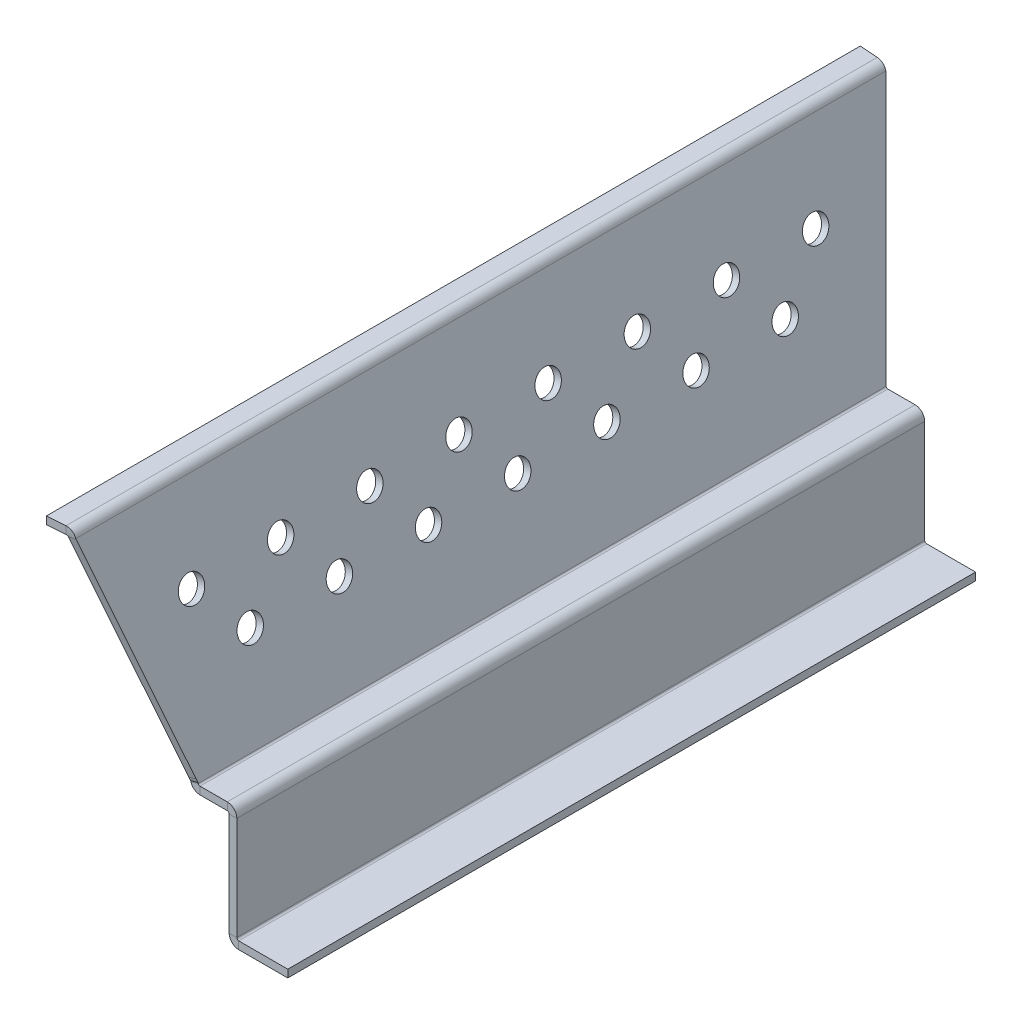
ISO-10303-21;
HEADER;
FILE_DESCRIPTION(('STEP AP214'),'2;1');
FILE_NAME('part.step','',(''),(''),'','','');
FILE_SCHEMA(('AUTOMOTIVE_DESIGN { 1 0 10303 214 1 1 1 1 }'));
ENDSEC;
DATA;
#1=APPLICATION_CONTEXT('core data for automotive mechanical design processes');
#2=APPLICATION_PROTOCOL_DEFINITION('international standard','automotive_design',2000,#1);
#3=PRODUCT_CONTEXT('',#1,'mechanical');
#4=PRODUCT('Part','Part','',(#3));
#5=PRODUCT_RELATED_PRODUCT_CATEGORY('part','',(#4));
#6=PRODUCT_DEFINITION_FORMATION('','',#4);
#7=PRODUCT_DEFINITION_CONTEXT('part definition',#1,'design');
#8=PRODUCT_DEFINITION('design','',#6,#7);
#9=PRODUCT_DEFINITION_SHAPE('','',#8);
#10=(LENGTH_UNIT() NAMED_UNIT(*) SI_UNIT(.MILLI.,.METRE.));
#11=(NAMED_UNIT(*) PLANE_ANGLE_UNIT() SI_UNIT($,.RADIAN.));
#12=(NAMED_UNIT(*) SI_UNIT($,.STERADIAN.) SOLID_ANGLE_UNIT());
#13=UNCERTAINTY_MEASURE_WITH_UNIT(LENGTH_MEASURE(1.E-05),#10,'distance_accuracy_value','');
#14=(GEOMETRIC_REPRESENTATION_CONTEXT(3) GLOBAL_UNCERTAINTY_ASSIGNED_CONTEXT((#13)) GLOBAL_UNIT_ASSIGNED_CONTEXT((#10,
#11,#12)) REPRESENTATION_CONTEXT('',''));
#15=CARTESIAN_POINT('',(0.,0.,0.));
#16=DIRECTION('',(0.,0.,1.));
#17=DIRECTION('',(1.,0.,0.));
#18=AXIS2_PLACEMENT_3D('',#15,#16,#17);
#19=CARTESIAN_POINT('',(-17.8819360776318,44.1666666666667,320.));
#20=DIRECTION('',(-0.960645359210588,-0.277777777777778,0.));
#21=DIRECTION('',(0.277777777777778,-0.960645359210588,0.));
#22=AXIS2_PLACEMENT_3D('',#19,#20,#21);
#23=PLANE('',#22);
#24=CARTESIAN_POINT('',(-27.6136512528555,77.8220839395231,55.));
#25=DIRECTION('',(-0.960645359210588,-0.277777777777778,0.));
#26=DIRECTION('',(0.277777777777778,-0.960645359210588,0.));
#27=AXIS2_PLACEMENT_3D('',#24,#25,#26);
#28=CIRCLE('',#27,4.99999999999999);
#29=CARTESIAN_POINT('',(-26.2247623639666,73.0188571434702,55.));
#30=VERTEX_POINT('',#29);
#31=EDGE_CURVE('E863',#30,#30,#28,.T.);
#32=ORIENTED_EDGE('',*,*,#31,.F.);
#33=EDGE_LOOP('',(#32));
#34=FACE_BOUND('',#33,.T.);
#35=CARTESIAN_POINT('',(-27.6136512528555,77.8220839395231,90.));
#36=DIRECTION('',(-0.960645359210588,-0.277777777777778,0.));
#37=DIRECTION('',(0.277777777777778,-0.960645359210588,0.));
#38=AXIS2_PLACEMENT_3D('',#35,#36,#37);
#39=CIRCLE('',#38,4.99999999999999);
#40=CARTESIAN_POINT('',(-26.2247623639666,73.0188571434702,90.));
#41=VERTEX_POINT('',#40);
#42=EDGE_CURVE('E857',#41,#41,#39,.T.);
#43=ORIENTED_EDGE('',*,*,#42,.F.);
#44=EDGE_LOOP('',(#43));
#45=FACE_BOUND('',#44,.T.);
#46=CARTESIAN_POINT('',(-27.6136512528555,77.8220839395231,125.));
#47=DIRECTION('',(-0.960645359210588,-0.277777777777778,0.));
#48=DIRECTION('',(0.277777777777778,-0.960645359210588,0.));
#49=AXIS2_PLACEMENT_3D('',#46,#47,#48);
#50=CIRCLE('',#49,4.99999999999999);
#51=CARTESIAN_POINT('',(-26.2247623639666,73.0188571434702,125.));
#52=VERTEX_POINT('',#51);
#53=EDGE_CURVE('E851',#52,#52,#50,.T.);
#54=ORIENTED_EDGE('',*,*,#53,.F.);
#55=EDGE_LOOP('',(#54));
#56=FACE_BOUND('',#55,.T.);
#57=CARTESIAN_POINT('',(-27.6136512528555,77.8220839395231,160.));
#58=DIRECTION('',(-0.960645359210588,-0.277777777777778,0.));
#59=DIRECTION('',(0.277777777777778,-0.960645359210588,0.));
#60=AXIS2_PLACEMENT_3D('',#57,#58,#59);
#61=CIRCLE('',#60,4.99999999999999);
#62=CARTESIAN_POINT('',(-26.2247623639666,73.0188571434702,160.));
#63=VERTEX_POINT('',#62);
#64=EDGE_CURVE('E845',#63,#63,#61,.T.);
#65=ORIENTED_EDGE('',*,*,#64,.F.);
#66=EDGE_LOOP('',(#65));
#67=FACE_BOUND('',#66,.T.);
#68=CARTESIAN_POINT('',(-27.6136512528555,77.8220839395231,195.));
#69=DIRECTION('',(-0.960645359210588,-0.277777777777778,0.));
#70=DIRECTION('',(0.277777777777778,-0.960645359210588,0.));
#71=AXIS2_PLACEMENT_3D('',#68,#69,#70);
#72=CIRCLE('',#71,4.99999999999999);
#73=CARTESIAN_POINT('',(-26.2247623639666,73.0188571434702,195.));
#74=VERTEX_POINT('',#73);
#75=EDGE_CURVE('E839',#74,#74,#72,.T.);
#76=ORIENTED_EDGE('',*,*,#75,.F.);
#77=EDGE_LOOP('',(#76));
#78=FACE_BOUND('',#77,.T.);
#79=CARTESIAN_POINT('',(-27.6136512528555,77.8220839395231,230.));
#80=DIRECTION('',(-0.960645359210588,-0.277777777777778,0.));
#81=DIRECTION('',(0.277777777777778,-0.960645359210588,0.));
#82=AXIS2_PLACEMENT_3D('',#79,#80,#81);
#83=CIRCLE('',#82,4.99999999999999);
#84=CARTESIAN_POINT('',(-26.2247623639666,73.0188571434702,230.));
#85=VERTEX_POINT('',#84);
#86=EDGE_CURVE('E833',#85,#85,#83,.T.);
#87=ORIENTED_EDGE('',*,*,#86,.F.);
#88=EDGE_LOOP('',(#87));
#89=FACE_BOUND('',#88,.T.);
#90=CARTESIAN_POINT('',(-33.169206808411,97.0349911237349,37.5));
#91=DIRECTION('',(-0.960645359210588,-0.277777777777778,0.));
#92=DIRECTION('',(0.277777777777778,-0.960645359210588,0.));
#93=AXIS2_PLACEMENT_3D('',#90,#91,#92);
#94=CIRCLE('',#93,4.99999999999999);
#95=CARTESIAN_POINT('',(-31.7803179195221,92.231764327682,37.5));
#96=VERTEX_POINT('',#95);
#97=EDGE_CURVE('E827',#96,#96,#94,.T.);
#98=ORIENTED_EDGE('',*,*,#97,.F.);
#99=EDGE_LOOP('',(#98));
#100=FACE_BOUND('',#99,.T.);
#101=CARTESIAN_POINT('',(-33.169206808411,97.0349911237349,72.5));
#102=DIRECTION('',(-0.960645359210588,-0.277777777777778,0.));
#103=DIRECTION('',(0.277777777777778,-0.960645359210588,0.));
#104=AXIS2_PLACEMENT_3D('',#101,#102,#103);
#105=CIRCLE('',#104,4.99999999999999);
#106=CARTESIAN_POINT('',(-31.7803179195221,92.231764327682,72.5));
#107=VERTEX_POINT('',#106);
#108=EDGE_CURVE('E821',#107,#107,#105,.T.);
#109=ORIENTED_EDGE('',*,*,#108,.F.);
#110=EDGE_LOOP('',(#109));
#111=FACE_BOUND('',#110,.T.);
#112=CARTESIAN_POINT('',(-33.169206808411,97.0349911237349,107.5));
#113=DIRECTION('',(-0.960645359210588,-0.277777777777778,0.));
#114=DIRECTION('',(0.277777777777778,-0.960645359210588,0.));
#115=AXIS2_PLACEMENT_3D('',#112,#113,#114);
#116=CIRCLE('',#115,4.99999999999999);
#117=CARTESIAN_POINT('',(-31.7803179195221,92.231764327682,107.5));
#118=VERTEX_POINT('',#117);
#119=EDGE_CURVE('E815',#118,#118,#116,.T.);
#120=ORIENTED_EDGE('',*,*,#119,.F.);
#121=EDGE_LOOP('',(#120));
#122=FACE_BOUND('',#121,.T.);
#123=CARTESIAN_POINT('',(-33.169206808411,97.0349911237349,142.5));
#124=DIRECTION('',(-0.960645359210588,-0.277777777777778,0.));
#125=DIRECTION('',(0.277777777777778,-0.960645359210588,0.));
#126=AXIS2_PLACEMENT_3D('',#123,#124,#125);
#127=CIRCLE('',#126,4.99999999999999);
#128=CARTESIAN_POINT('',(-31.7803179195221,92.231764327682,142.5));
#129=VERTEX_POINT('',#128);
#130=EDGE_CURVE('E809',#129,#129,#127,.T.);
#131=ORIENTED_EDGE('',*,*,#130,.F.);
#132=EDGE_LOOP('',(#131));
#133=FACE_BOUND('',#132,.T.);
#134=CARTESIAN_POINT('',(-33.169206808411,97.0349911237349,177.5));
#135=DIRECTION('',(-0.960645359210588,-0.277777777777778,0.));
#136=DIRECTION('',(0.277777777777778,-0.960645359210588,0.));
#137=AXIS2_PLACEMENT_3D('',#134,#135,#136);
#138=CIRCLE('',#137,4.99999999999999);
#139=CARTESIAN_POINT('',(-31.7803179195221,92.231764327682,177.5));
#140=VERTEX_POINT('',#139);
#141=EDGE_CURVE('E803',#140,#140,#138,.T.);
#142=ORIENTED_EDGE('',*,*,#141,.F.);
#143=EDGE_LOOP('',(#142));
#144=FACE_BOUND('',#143,.T.);
#145=CARTESIAN_POINT('',(-33.169206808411,97.0349911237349,212.5));
#146=DIRECTION('',(-0.960645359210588,-0.277777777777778,0.));
#147=DIRECTION('',(0.277777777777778,-0.960645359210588,0.));
#148=AXIS2_PLACEMENT_3D('',#145,#146,#147);
#149=CIRCLE('',#148,4.99999999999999);
#150=CARTESIAN_POINT('',(-31.7803179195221,92.231764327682,212.5));
#151=VERTEX_POINT('',#150);
#152=EDGE_CURVE('E797',#151,#151,#149,.T.);
#153=ORIENTED_EDGE('',*,*,#152,.F.);
#154=EDGE_LOOP('',(#153));
#155=FACE_BOUND('',#154,.T.);
#156=CARTESIAN_POINT('',(-33.169206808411,97.0349911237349,247.5));
#157=DIRECTION('',(-0.960645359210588,-0.277777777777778,0.));
#158=DIRECTION('',(0.277777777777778,-0.960645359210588,0.));
#159=AXIS2_PLACEMENT_3D('',#156,#157,#158);
#160=CIRCLE('',#159,4.99999999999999);
#161=CARTESIAN_POINT('',(-31.7803179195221,92.231764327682,247.5));
#162=VERTEX_POINT('',#161);
#163=EDGE_CURVE('E791',#162,#162,#160,.T.);
#164=ORIENTED_EDGE('',*,*,#163,.F.);
#165=EDGE_LOOP('',(#164));
#166=FACE_BOUND('',#165,.T.);
#167=CARTESIAN_POINT('',(-27.6136512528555,77.8220839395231,265.));
#168=DIRECTION('',(-0.960645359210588,-0.277777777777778,0.));
#169=DIRECTION('',(0.277777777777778,-0.960645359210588,0.));
#170=AXIS2_PLACEMENT_3D('',#167,#168,#169);
#171=CIRCLE('',#170,4.99999999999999);
#172=CARTESIAN_POINT('',(-26.2247623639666,73.0188571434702,265.));
#173=VERTEX_POINT('',#172);
#174=EDGE_CURVE('E785',#173,#173,#171,.T.);
#175=ORIENTED_EDGE('',*,*,#174,.F.);
#176=EDGE_LOOP('',(#175));
#177=FACE_BOUND('',#176,.T.);
#178=CARTESIAN_POINT('',(-33.169206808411,97.0349911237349,282.5));
#179=DIRECTION('',(-0.960645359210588,-0.277777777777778,0.));
#180=DIRECTION('',(0.277777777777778,-0.960645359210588,0.));
#181=AXIS2_PLACEMENT_3D('',#178,#179,#180);
#182=CIRCLE('',#181,4.99999999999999);
#183=CARTESIAN_POINT('',(-31.7803179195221,92.231764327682,282.5));
#184=VERTEX_POINT('',#183);
#185=EDGE_CURVE('E538',#184,#184,#182,.T.);
#186=ORIENTED_EDGE('',*,*,#185,.F.);
#187=EDGE_LOOP('',(#186));
#188=FACE_BOUND('',#187,.T.);
#189=DIRECTION('',(0.,0.,-1.));
#190=VECTOR('',#189,1.);
#191=CARTESIAN_POINT('',(-42.0988012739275,127.916415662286,320.));
#192=LINE('',#191,#190);
#193=CARTESIAN_POINT('',(-42.0988012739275,127.916415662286,318.99725391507));
#194=VERTEX_POINT('',#193);
#195=CARTESIAN_POINT('',(-42.0988012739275,127.916415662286,1.00267387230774));
#196=VERTEX_POINT('',#195);
#197=EDGE_CURVE('E561',#194,#196,#192,.T.);
#198=ORIENTED_EDGE('',*,*,#197,.T.);
#199=DIRECTION('',(-0.267650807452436,0.925623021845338,-0.267553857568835));
#200=VECTOR('',#199,1.);
#201=CARTESIAN_POINT('',(3.22821745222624,-28.8390690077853,46.3132740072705));
#202=LINE('',#201,#200);
#203=CARTESIAN_POINT('',(-18.4814648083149,46.2400308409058,24.6114555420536));
#204=VERTEX_POINT('',#203);
#205=EDGE_CURVE('E771',#204,#196,#202,.T.);
#206=ORIENTED_EDGE('',*,*,#205,.F.);
#207=DIRECTION('',(-0.269880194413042,0.933332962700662,-0.236757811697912));
#208=VECTOR('',#207,1.);
#209=CARTESIAN_POINT('',(0.958676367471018,-20.9902622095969,41.6657091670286));
#210=LINE('',#209,#208);
#211=CARTESIAN_POINT('',(-18.1229006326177,45.,24.9260131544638));
#212=VERTEX_POINT('',#211);
#213=EDGE_CURVE('E767',#212,#204,#210,.T.);
#214=ORIENTED_EDGE('',*,*,#213,.F.);
#215=DIRECTION('',(0.,0.,-1.));
#216=VECTOR('',#215,1.);
#217=CARTESIAN_POINT('',(-18.1229006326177,45.,320.));
#218=LINE('',#217,#216);
#219=CARTESIAN_POINT('',(-18.1229006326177,45.,25.));
#220=VERTEX_POINT('',#219);
#221=EDGE_CURVE('E679',#220,#212,#218,.T.);
#222=ORIENTED_EDGE('',*,*,#221,.F.);
#223=DIRECTION('',(-0.277777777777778,0.960645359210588,0.));
#224=VECTOR('',#223,1.);
#225=CARTESIAN_POINT('',(-17.8819360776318,44.1666666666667,25.));
#226=LINE('',#225,#224);
#227=CARTESIAN_POINT('',(-18.0385630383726,44.7083333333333,25.));
#228=VERTEX_POINT('',#227);
#229=EDGE_CURVE('E684',#228,#220,#226,.T.);
#230=ORIENTED_EDGE('',*,*,#229,.F.);
#231=DIRECTION('',(0.,0.,-1.));
#232=VECTOR('',#231,1.);
#233=CARTESIAN_POINT('',(-18.0385630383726,44.7083333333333,320.));
#234=LINE('',#233,#232);
#235=CARTESIAN_POINT('',(-18.0385630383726,44.7083333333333,295.));
#236=VERTEX_POINT('',#235);
#237=EDGE_CURVE('E563',#236,#228,#234,.T.);
#238=ORIENTED_EDGE('',*,*,#237,.F.);
#239=DIRECTION('',(0.277777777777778,-0.960645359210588,0.));
#240=VECTOR('',#239,1.);
#241=CARTESIAN_POINT('',(-17.8819360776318,44.1666666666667,295.));
#242=LINE('',#241,#240);
#243=CARTESIAN_POINT('',(-18.1229006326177,45.,295.));
#244=VERTEX_POINT('',#243);
#245=EDGE_CURVE('E619',#244,#236,#242,.T.);
#246=ORIENTED_EDGE('',*,*,#245,.F.);
#247=DIRECTION('',(-0.2659892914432,0.91987696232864,0.288229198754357));
#248=VECTOR('',#247,1.);
#249=CARTESIAN_POINT('',(-19.8186014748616,50.8642817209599,296.83748184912));
#250=LINE('',#249,#248);
#251=CARTESIAN_POINT('',(-18.481464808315,46.240030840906,295.388544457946));
#252=VERTEX_POINT('',#251);
#253=EDGE_CURVE('E744',#244,#252,#250,.T.);
#254=ORIENTED_EDGE('',*,*,#253,.T.);
#255=DIRECTION('',(-0.267650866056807,0.9256232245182,0.267553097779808));
#256=VECTOR('',#255,1.);
#257=CARTESIAN_POINT('',(-19.6872996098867,50.4101974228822,296.593938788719));
#258=LINE('',#257,#256);
#259=EDGE_CURVE('E747',#252,#194,#258,.T.);
#260=ORIENTED_EDGE('',*,*,#259,.T.);
#261=EDGE_LOOP('',(#198,#206,#214,#222,#230,#238,#246,#254,#260));
#262=FACE_BOUND('',#261,.T.);
#263=ADVANCED_FACE('F356',(#34,#45,#56,#67,#78,#89,#100,#111,#122,#133,#144,#155,#166,#177,#188,
#262),#23,.T.);
#264=CARTESIAN_POINT('',(-15.,45.,320.));
#265=DIRECTION('',(-0.960645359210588,-0.277777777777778,0.));
#266=DIRECTION('',(0.277777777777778,-0.960645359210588,0.));
#267=AXIS2_PLACEMENT_3D('',#264,#265,#266);
#268=PLANE('',#267);
#269=CARTESIAN_POINT('',(-24.7317151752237,78.6554172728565,55.));
#270=DIRECTION('',(0.960645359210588,0.277777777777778,0.));
#271=DIRECTION('',(-0.277777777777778,0.960645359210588,0.));
#272=AXIS2_PLACEMENT_3D('',#269,#270,#271);
#273=CIRCLE('',#272,4.99999999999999);
#274=CARTESIAN_POINT('',(-26.1206040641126,83.4586440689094,55.));
#275=VERTEX_POINT('',#274);
#276=EDGE_CURVE('E866',#275,#275,#273,.T.);
#277=ORIENTED_EDGE('',*,*,#276,.F.);
#278=EDGE_LOOP('',(#277));
#279=FACE_BOUND('',#278,.T.);
#280=CARTESIAN_POINT('',(-24.7317151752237,78.6554172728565,90.));
#281=DIRECTION('',(0.960645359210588,0.277777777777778,0.));
#282=DIRECTION('',(-0.277777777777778,0.960645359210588,0.));
#283=AXIS2_PLACEMENT_3D('',#280,#281,#282);
#284=CIRCLE('',#283,4.99999999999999);
#285=CARTESIAN_POINT('',(-26.1206040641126,83.4586440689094,90.));
#286=VERTEX_POINT('',#285);
#287=EDGE_CURVE('E860',#286,#286,#284,.T.);
#288=ORIENTED_EDGE('',*,*,#287,.F.);
#289=EDGE_LOOP('',(#288));
#290=FACE_BOUND('',#289,.T.);
#291=CARTESIAN_POINT('',(-24.7317151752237,78.6554172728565,125.));
#292=DIRECTION('',(0.960645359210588,0.277777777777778,0.));
#293=DIRECTION('',(-0.277777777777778,0.960645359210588,0.));
#294=AXIS2_PLACEMENT_3D('',#291,#292,#293);
#295=CIRCLE('',#294,4.99999999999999);
#296=CARTESIAN_POINT('',(-26.1206040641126,83.4586440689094,125.));
#297=VERTEX_POINT('',#296);
#298=EDGE_CURVE('E854',#297,#297,#295,.T.);
#299=ORIENTED_EDGE('',*,*,#298,.F.);
#300=EDGE_LOOP('',(#299));
#301=FACE_BOUND('',#300,.T.);
#302=CARTESIAN_POINT('',(-24.7317151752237,78.6554172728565,160.));
#303=DIRECTION('',(0.960645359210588,0.277777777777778,0.));
#304=DIRECTION('',(-0.277777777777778,0.960645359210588,0.));
#305=AXIS2_PLACEMENT_3D('',#302,#303,#304);
#306=CIRCLE('',#305,4.99999999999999);
#307=CARTESIAN_POINT('',(-26.1206040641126,83.4586440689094,160.));
#308=VERTEX_POINT('',#307);
#309=EDGE_CURVE('E848',#308,#308,#306,.T.);
#310=ORIENTED_EDGE('',*,*,#309,.F.);
#311=EDGE_LOOP('',(#310));
#312=FACE_BOUND('',#311,.T.);
#313=CARTESIAN_POINT('',(-24.7317151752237,78.6554172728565,195.));
#314=DIRECTION('',(0.960645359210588,0.277777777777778,0.));
#315=DIRECTION('',(-0.277777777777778,0.960645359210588,0.));
#316=AXIS2_PLACEMENT_3D('',#313,#314,#315);
#317=CIRCLE('',#316,4.99999999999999);
#318=CARTESIAN_POINT('',(-26.1206040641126,83.4586440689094,195.));
#319=VERTEX_POINT('',#318);
#320=EDGE_CURVE('E842',#319,#319,#317,.T.);
#321=ORIENTED_EDGE('',*,*,#320,.F.);
#322=EDGE_LOOP('',(#321));
#323=FACE_BOUND('',#322,.T.);
#324=CARTESIAN_POINT('',(-24.7317151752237,78.6554172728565,230.));
#325=DIRECTION('',(0.960645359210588,0.277777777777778,0.));
#326=DIRECTION('',(-0.277777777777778,0.960645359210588,0.));
#327=AXIS2_PLACEMENT_3D('',#324,#325,#326);
#328=CIRCLE('',#327,4.99999999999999);
#329=CARTESIAN_POINT('',(-26.1206040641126,83.4586440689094,230.));
#330=VERTEX_POINT('',#329);
#331=EDGE_CURVE('E836',#330,#330,#328,.T.);
#332=ORIENTED_EDGE('',*,*,#331,.F.);
#333=EDGE_LOOP('',(#332));
#334=FACE_BOUND('',#333,.T.);
#335=CARTESIAN_POINT('',(-30.2872707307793,97.8683244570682,37.5));
#336=DIRECTION('',(0.960645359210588,0.277777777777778,0.));
#337=DIRECTION('',(-0.277777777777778,0.960645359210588,0.));
#338=AXIS2_PLACEMENT_3D('',#335,#336,#337);
#339=CIRCLE('',#338,4.99999999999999);
#340=CARTESIAN_POINT('',(-31.6761596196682,102.671551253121,37.5));
#341=VERTEX_POINT('',#340);
#342=EDGE_CURVE('E830',#341,#341,#339,.T.);
#343=ORIENTED_EDGE('',*,*,#342,.F.);
#344=EDGE_LOOP('',(#343));
#345=FACE_BOUND('',#344,.T.);
#346=CARTESIAN_POINT('',(-30.2872707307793,97.8683244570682,72.5));
#347=DIRECTION('',(0.960645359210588,0.277777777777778,0.));
#348=DIRECTION('',(-0.277777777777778,0.960645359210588,0.));
#349=AXIS2_PLACEMENT_3D('',#346,#347,#348);
#350=CIRCLE('',#349,4.99999999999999);
#351=CARTESIAN_POINT('',(-31.6761596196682,102.671551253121,72.5));
#352=VERTEX_POINT('',#351);
#353=EDGE_CURVE('E824',#352,#352,#350,.T.);
#354=ORIENTED_EDGE('',*,*,#353,.F.);
#355=EDGE_LOOP('',(#354));
#356=FACE_BOUND('',#355,.T.);
#357=CARTESIAN_POINT('',(-30.2872707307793,97.8683244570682,107.5));
#358=DIRECTION('',(0.960645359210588,0.277777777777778,0.));
#359=DIRECTION('',(-0.277777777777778,0.960645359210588,0.));
#360=AXIS2_PLACEMENT_3D('',#357,#358,#359);
#361=CIRCLE('',#360,4.99999999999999);
#362=CARTESIAN_POINT('',(-31.6761596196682,102.671551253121,107.5));
#363=VERTEX_POINT('',#362);
#364=EDGE_CURVE('E818',#363,#363,#361,.T.);
#365=ORIENTED_EDGE('',*,*,#364,.F.);
#366=EDGE_LOOP('',(#365));
#367=FACE_BOUND('',#366,.T.);
#368=CARTESIAN_POINT('',(-30.2872707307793,97.8683244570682,142.5));
#369=DIRECTION('',(0.960645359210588,0.277777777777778,0.));
#370=DIRECTION('',(-0.277777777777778,0.960645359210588,0.));
#371=AXIS2_PLACEMENT_3D('',#368,#369,#370);
#372=CIRCLE('',#371,4.99999999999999);
#373=CARTESIAN_POINT('',(-31.6761596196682,102.671551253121,142.5));
#374=VERTEX_POINT('',#373);
#375=EDGE_CURVE('E812',#374,#374,#372,.T.);
#376=ORIENTED_EDGE('',*,*,#375,.F.);
#377=EDGE_LOOP('',(#376));
#378=FACE_BOUND('',#377,.T.);
#379=CARTESIAN_POINT('',(-30.2872707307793,97.8683244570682,177.5));
#380=DIRECTION('',(0.960645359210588,0.277777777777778,0.));
#381=DIRECTION('',(-0.277777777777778,0.960645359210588,0.));
#382=AXIS2_PLACEMENT_3D('',#379,#380,#381);
#383=CIRCLE('',#382,4.99999999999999);
#384=CARTESIAN_POINT('',(-31.6761596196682,102.671551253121,177.5));
#385=VERTEX_POINT('',#384);
#386=EDGE_CURVE('E806',#385,#385,#383,.T.);
#387=ORIENTED_EDGE('',*,*,#386,.F.);
#388=EDGE_LOOP('',(#387));
#389=FACE_BOUND('',#388,.T.);
#390=CARTESIAN_POINT('',(-30.2872707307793,97.8683244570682,212.5));
#391=DIRECTION('',(0.960645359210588,0.277777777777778,0.));
#392=DIRECTION('',(-0.277777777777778,0.960645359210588,0.));
#393=AXIS2_PLACEMENT_3D('',#390,#391,#392);
#394=CIRCLE('',#393,4.99999999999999);
#395=CARTESIAN_POINT('',(-31.6761596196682,102.671551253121,212.5));
#396=VERTEX_POINT('',#395);
#397=EDGE_CURVE('E800',#396,#396,#394,.T.);
#398=ORIENTED_EDGE('',*,*,#397,.F.);
#399=EDGE_LOOP('',(#398));
#400=FACE_BOUND('',#399,.T.);
#401=CARTESIAN_POINT('',(-30.2872707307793,97.8683244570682,247.5));
#402=DIRECTION('',(0.960645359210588,0.277777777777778,0.));
#403=DIRECTION('',(-0.277777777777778,0.960645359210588,0.));
#404=AXIS2_PLACEMENT_3D('',#401,#402,#403);
#405=CIRCLE('',#404,4.99999999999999);
#406=CARTESIAN_POINT('',(-31.6761596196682,102.671551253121,247.5));
#407=VERTEX_POINT('',#406);
#408=EDGE_CURVE('E794',#407,#407,#405,.T.);
#409=ORIENTED_EDGE('',*,*,#408,.F.);
#410=EDGE_LOOP('',(#409));
#411=FACE_BOUND('',#410,.T.);
#412=CARTESIAN_POINT('',(-24.7317151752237,78.6554172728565,265.));
#413=DIRECTION('',(0.960645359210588,0.277777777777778,0.));
#414=DIRECTION('',(-0.277777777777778,0.960645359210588,0.));
#415=AXIS2_PLACEMENT_3D('',#412,#413,#414);
#416=CIRCLE('',#415,4.99999999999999);
#417=CARTESIAN_POINT('',(-26.1206040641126,83.4586440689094,265.));
#418=VERTEX_POINT('',#417);
#419=EDGE_CURVE('E788',#418,#418,#416,.T.);
#420=ORIENTED_EDGE('',*,*,#419,.F.);
#421=EDGE_LOOP('',(#420));
#422=FACE_BOUND('',#421,.T.);
#423=CARTESIAN_POINT('',(-30.2872707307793,97.8683244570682,282.5));
#424=DIRECTION('',(0.960645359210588,0.277777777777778,0.));
#425=DIRECTION('',(-0.277777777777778,0.960645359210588,0.));
#426=AXIS2_PLACEMENT_3D('',#423,#424,#425);
#427=CIRCLE('',#426,4.99999999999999);
#428=CARTESIAN_POINT('',(-31.6761596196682,102.671551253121,282.5));
#429=VERTEX_POINT('',#428);
#430=EDGE_CURVE('E782',#429,#429,#427,.T.);
#431=ORIENTED_EDGE('',*,*,#430,.F.);
#432=EDGE_LOOP('',(#431));
#433=FACE_BOUND('',#432,.T.);
#434=DIRECTION('',(-0.267650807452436,0.925623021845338,-0.267553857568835));
#435=VECTOR('',#434,1.);
#436=CARTESIAN_POINT('',(6.110153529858,-28.0057356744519,46.3132740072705));
#437=LINE('',#436,#435);
#438=CARTESIAN_POINT('',(-15.5995287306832,47.0733641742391,24.6114555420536));
#439=VERTEX_POINT('',#438);
#440=CARTESIAN_POINT('',(-39.2168651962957,128.74974899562,1.00267387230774));
#441=VERTEX_POINT('',#440);
#442=EDGE_CURVE('E774',#439,#441,#437,.T.);
#443=ORIENTED_EDGE('',*,*,#442,.T.);
#444=DIRECTION('',(0.,0.,-1.));
#445=VECTOR('',#444,1.);
#446=CARTESIAN_POINT('',(-39.2168651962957,128.74974899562,320.));
#447=LINE('',#446,#445);
#448=CARTESIAN_POINT('',(-39.2168651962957,128.74974899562,318.99725391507));
#449=VERTEX_POINT('',#448);
#450=EDGE_CURVE('E607',#449,#441,#447,.T.);
#451=ORIENTED_EDGE('',*,*,#450,.F.);
#452=DIRECTION('',(-0.267650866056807,0.9256232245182,0.267553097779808));
#453=VECTOR('',#452,1.);
#454=CARTESIAN_POINT('',(-16.8053635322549,51.2435307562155,296.593938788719));
#455=LINE('',#454,#453);
#456=CARTESIAN_POINT('',(-15.5995287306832,47.0733641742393,295.388544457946));
#457=VERTEX_POINT('',#456);
#458=EDGE_CURVE('E742',#457,#449,#455,.T.);
#459=ORIENTED_EDGE('',*,*,#458,.F.);
#460=DIRECTION('',(-0.2659892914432,0.91987696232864,0.288229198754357));
#461=VECTOR('',#460,1.);
#462=CARTESIAN_POINT('',(-16.9366653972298,51.6976150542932,296.83748184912));
#463=LINE('',#462,#461);
#464=CARTESIAN_POINT('',(-15.2409645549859,45.8333333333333,295.));
#465=VERTEX_POINT('',#464);
#466=EDGE_CURVE('E738',#465,#457,#463,.T.);
#467=ORIENTED_EDGE('',*,*,#466,.F.);
#468=DIRECTION('',(0.277777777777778,-0.960645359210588,0.));
#469=VECTOR('',#468,1.);
#470=CARTESIAN_POINT('',(-15.,45.,295.));
#471=LINE('',#470,#469);
#472=CARTESIAN_POINT('',(-15.1566269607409,45.5416666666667,295.));
#473=VERTEX_POINT('',#472);
#474=EDGE_CURVE('E615',#465,#473,#471,.T.);
#475=ORIENTED_EDGE('',*,*,#474,.T.);
#476=DIRECTION('',(0.,0.,-1.));
#477=VECTOR('',#476,1.);
#478=CARTESIAN_POINT('',(-15.1566269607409,45.5416666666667,320.));
#479=LINE('',#478,#477);
#480=CARTESIAN_POINT('',(-15.1566269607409,45.5416666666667,25.));
#481=VERTEX_POINT('',#480);
#482=EDGE_CURVE('E604',#473,#481,#479,.T.);
#483=ORIENTED_EDGE('',*,*,#482,.T.);
#484=DIRECTION('',(0.277777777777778,-0.960645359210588,0.));
#485=VECTOR('',#484,1.);
#486=CARTESIAN_POINT('',(-15.,45.,25.));
#487=LINE('',#486,#485);
#488=CARTESIAN_POINT('',(-15.2409645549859,45.8333333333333,25.));
#489=VERTEX_POINT('',#488);
#490=EDGE_CURVE('E676',#481,#489,#487,.F.);
#491=ORIENTED_EDGE('',*,*,#490,.T.);
#492=DIRECTION('',(0.,0.,1.));
#493=VECTOR('',#492,1.);
#494=CARTESIAN_POINT('',(-15.2409645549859,45.8333333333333,320.));
#495=LINE('',#494,#493);
#496=CARTESIAN_POINT('',(-15.2409645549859,45.8333333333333,24.9260131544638));
#497=VERTEX_POINT('',#496);
#498=EDGE_CURVE('E673',#489,#497,#495,.F.);
#499=ORIENTED_EDGE('',*,*,#498,.T.);
#500=DIRECTION('',(-0.269880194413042,0.933332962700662,-0.236757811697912));
#501=VECTOR('',#500,1.);
#502=CARTESIAN_POINT('',(3.84061244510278,-20.1569288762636,41.6657091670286));
#503=LINE('',#502,#501);
#504=EDGE_CURVE('E371',#497,#439,#503,.T.);
#505=ORIENTED_EDGE('',*,*,#504,.T.);
#506=EDGE_LOOP('',(#443,#451,#459,#467,#475,#483,#491,#499,#505));
#507=FACE_BOUND('',#506,.T.);
#508=ADVANCED_FACE('F872',(#279,#290,#301,#312,#323,#334,#345,#356,#367,#378,#389,#400,#411,
#422,#433,#507),#268,.F.);
#509=CARTESIAN_POINT('',(-40.,131.458082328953,320.));
#510=DIRECTION('',(0.,-1.,0.));
#511=DIRECTION('',(0.,0.,-1.));
#512=AXIS2_PLACEMENT_3D('',#509,#510,#511);
#513=PLANE('',#512);
#514=DIRECTION('',(-0.997038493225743,0.,-0.0769041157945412));
#515=VECTOR('',#514,1.);
#516=CARTESIAN_POINT('',(-15.5417789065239,131.458082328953,2.90659538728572));
#517=LINE('',#516,#515);
#518=CARTESIAN_POINT('',(-42.8192852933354,131.458082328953,0.802611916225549));
#519=VERTEX_POINT('',#518);
#520=CARTESIAN_POINT('',(-50.,131.458082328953,0.248745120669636));
#521=VERTEX_POINT('',#520);
#522=EDGE_CURVE('E546',#519,#521,#517,.T.);
#523=ORIENTED_EDGE('',*,*,#522,.T.);
#524=DIRECTION('',(0.,0.,-1.));
#525=VECTOR('',#524,1.);
#526=CARTESIAN_POINT('',(-50.,131.458082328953,320.));
#527=LINE('',#526,#525);
#528=CARTESIAN_POINT('',(-50.,131.458082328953,319.751180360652));
#529=VERTEX_POINT('',#528);
#530=EDGE_CURVE('E11',#529,#521,#527,.T.);
#531=ORIENTED_EDGE('',*,*,#530,.F.);
#532=DIRECTION('',(-0.997038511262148,0.,0.0769038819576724));
#533=VECTOR('',#532,1.);
#534=CARTESIAN_POINT('',(-40.0782205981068,131.458082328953,318.985890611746));
#535=LINE('',#534,#533);
#536=CARTESIAN_POINT('',(-42.8192852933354,131.458082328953,319.197315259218));
#537=VERTEX_POINT('',#536);
#538=EDGE_CURVE('E754',#537,#529,#535,.T.);
#539=ORIENTED_EDGE('',*,*,#538,.F.);
#540=DIRECTION('',(0.,0.,-1.));
#541=VECTOR('',#540,1.);
#542=CARTESIAN_POINT('',(-42.8192852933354,131.458082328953,320.));
#543=LINE('',#542,#541);
#544=EDGE_CURVE('E610',#537,#519,#543,.T.);
#545=ORIENTED_EDGE('',*,*,#544,.T.);
#546=EDGE_LOOP('',(#523,#531,#539,#545));
#547=FACE_BOUND('',#546,.T.);
#548=ADVANCED_FACE('F358',(#547),#513,.F.);
#549=CARTESIAN_POINT('',(-50.,128.458082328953,320.));
#550=DIRECTION('',(-1.,0.,0.));
#551=DIRECTION('',(0.,0.,1.));
#552=AXIS2_PLACEMENT_3D('',#549,#550,#551);
#553=PLANE('',#552);
#554=ORIENTED_EDGE('',*,*,#530,.T.);
#555=DIRECTION('',(0.,-1.,0.));
#556=VECTOR('',#555,1.);
#557=CARTESIAN_POINT('',(-50.,128.458082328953,0.248745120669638));
#558=LINE('',#557,#556);
#559=CARTESIAN_POINT('',(-50.,128.458082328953,0.248745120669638));
#560=VERTEX_POINT('',#559);
#561=EDGE_CURVE('E547',#560,#521,#558,.F.);
#562=ORIENTED_EDGE('',*,*,#561,.F.);
#563=DIRECTION('',(0.,0.,-1.));
#564=VECTOR('',#563,1.);
#565=CARTESIAN_POINT('',(-50.,128.458082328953,320.));
#566=LINE('',#565,#564);
#567=CARTESIAN_POINT('',(-50.,128.458082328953,319.751180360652));
#568=VERTEX_POINT('',#567);
#569=EDGE_CURVE('E364',#568,#560,#566,.T.);
#570=ORIENTED_EDGE('',*,*,#569,.F.);
#571=DIRECTION('',(0.,-1.,0.));
#572=VECTOR('',#571,1.);
#573=CARTESIAN_POINT('',(-50.,128.458082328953,319.751180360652));
#574=LINE('',#573,#572);
#575=EDGE_CURVE('E750',#568,#529,#574,.F.);
#576=ORIENTED_EDGE('',*,*,#575,.T.);
#577=EDGE_LOOP('',(#554,#562,#570,#576));
#578=FACE_BOUND('',#577,.T.);
#579=ADVANCED_FACE('F920',(#578),#553,.T.);
#580=CARTESIAN_POINT('',(-40.,128.458082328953,320.));
#581=DIRECTION('',(0.,-1.,0.));
#582=DIRECTION('',(0.,0.,-1.));
#583=AXIS2_PLACEMENT_3D('',#580,#581,#582);
#584=PLANE('',#583);
#585=ORIENTED_EDGE('',*,*,#569,.T.);
#586=DIRECTION('',(-0.997038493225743,0.,-0.0769041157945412));
#587=VECTOR('',#586,1.);
#588=CARTESIAN_POINT('',(-15.5417789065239,128.458082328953,2.90659538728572));
#589=LINE('',#588,#587);
#590=CARTESIAN_POINT('',(-42.8192852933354,128.458082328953,0.802611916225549));
#591=VERTEX_POINT('',#590);
#592=EDGE_CURVE('E543',#591,#560,#589,.T.);
#593=ORIENTED_EDGE('',*,*,#592,.F.);
#594=DIRECTION('',(0.,0.,-1.));
#595=VECTOR('',#594,1.);
#596=CARTESIAN_POINT('',(-42.8192852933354,128.458082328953,320.));
#597=LINE('',#596,#595);
#598=CARTESIAN_POINT('',(-42.8192852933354,128.458082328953,319.197315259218));
#599=VERTEX_POINT('',#598);
#600=EDGE_CURVE('E554',#599,#591,#597,.T.);
#601=ORIENTED_EDGE('',*,*,#600,.F.);
#602=DIRECTION('',(-0.997038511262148,0.,0.0769038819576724));
#603=VECTOR('',#602,1.);
#604=CARTESIAN_POINT('',(-40.0782205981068,128.458082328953,318.985890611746));
#605=LINE('',#604,#603);
#606=EDGE_CURVE('E758',#599,#568,#605,.T.);
#607=ORIENTED_EDGE('',*,*,#606,.T.);
#608=EDGE_LOOP('',(#585,#593,#601,#607));
#609=FACE_BOUND('',#608,.T.);
#610=ADVANCED_FACE('F552',(#609),#584,.T.);
#611=CARTESIAN_POINT('',(-42.8192852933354,127.708082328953,320.));
#612=DIRECTION('',(0.,0.,-1.));
#613=DIRECTION('',(-1.,0.,0.));
#614=AXIS2_PLACEMENT_3D('',#611,#612,#613);
#615=CYLINDRICAL_SURFACE('',#614,0.75);
#616=ORIENTED_EDGE('',*,*,#600,.T.);
#617=CARTESIAN_POINT('',(-42.8192852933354,127.708082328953,1.00267387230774));
#618=DIRECTION('',(-0.0743205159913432,0.257024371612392,0.96354290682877));
#619=DIRECTION('',(-0.267650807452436,0.925623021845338,-0.267553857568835));
#620=AXIS2_PLACEMENT_3D('',#617,#618,#619);
#621=ELLIPSE('',#620,0.778377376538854,0.75);
#622=EDGE_CURVE('E526',#196,#591,#621,.T.);
#623=ORIENTED_EDGE('',*,*,#622,.F.);
#624=ORIENTED_EDGE('',*,*,#197,.F.);
#625=CARTESIAN_POINT('',(-42.8192852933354,127.708082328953,318.99725391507));
#626=DIRECTION('',(0.0743203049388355,-0.257023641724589,0.963543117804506));
#627=DIRECTION('',(0.267650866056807,-0.9256232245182,-0.267553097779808));
#628=AXIS2_PLACEMENT_3D('',#625,#626,#627);
#629=ELLIPSE('',#628,0.778377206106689,0.75);
#630=EDGE_CURVE('E560',#194,#599,#629,.T.);
#631=ORIENTED_EDGE('',*,*,#630,.T.);
#632=EDGE_LOOP('',(#616,#623,#624,#631));
#633=FACE_BOUND('',#632,.T.);
#634=ADVANCED_FACE('F558',(#633),#615,.F.);
#635=CARTESIAN_POINT('',(-42.8192852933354,127.708082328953,320.));
#636=DIRECTION('',(0.,0.,-1.));
#637=DIRECTION('',(-1.,0.,0.));
#638=AXIS2_PLACEMENT_3D('',#635,#636,#637);
#639=CYLINDRICAL_SURFACE('',#638,3.75);
#640=CARTESIAN_POINT('',(-42.8192852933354,127.708082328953,1.00267387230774));
#641=DIRECTION('',(-0.0154027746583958,0.0532677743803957,0.998461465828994));
#642=DIRECTION('',(-0.277350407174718,0.959167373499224,-0.0554499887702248));
#643=AXIS2_PLACEMENT_3D('',#640,#641,#642);
#644=ELLIPSE('',#643,3.75577839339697,3.75);
#645=EDGE_CURVE('E537',#441,#519,#644,.T.);
#646=ORIENTED_EDGE('',*,*,#645,.T.);
#647=ORIENTED_EDGE('',*,*,#544,.F.);
#648=CARTESIAN_POINT('',(-42.8192852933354,127.708082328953,318.99725391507));
#649=DIRECTION('',(0.0154027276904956,-0.0532676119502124,0.998461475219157));
#650=DIRECTION('',(0.277350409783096,-0.959167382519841,-0.0554498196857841));
#651=AXIS2_PLACEMENT_3D('',#648,#649,#650);
#652=ELLIPSE('',#651,3.75577835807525,3.75);
#653=EDGE_CURVE('E760',#449,#537,#652,.T.);
#654=ORIENTED_EDGE('',*,*,#653,.F.);
#655=ORIENTED_EDGE('',*,*,#450,.T.);
#656=EDGE_LOOP('',(#646,#647,#654,#655));
#657=FACE_BOUND('',#656,.T.);
#658=ADVANCED_FACE('F909',(#657),#639,.T.);
#659=CARTESIAN_POINT('',(-18.1229006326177,45.,320.));
#660=DIRECTION('',(-0.277777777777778,0.960645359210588,0.));
#661=DIRECTION('',(0.,0.,-1.));
#662=AXIS2_PLACEMENT_3D('',#659,#660,#661);
#663=PLANE('',#662);
#664=ORIENTED_EDGE('',*,*,#221,.T.);
#665=DIRECTION('',(0.960645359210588,0.277777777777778,0.));
#666=VECTOR('',#665,1.);
#667=CARTESIAN_POINT('',(-15.2409645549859,45.8333333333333,24.9260131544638));
#668=LINE('',#667,#666);
#669=EDGE_CURVE('E763',#497,#212,#668,.F.);
#670=ORIENTED_EDGE('',*,*,#669,.F.);
#671=ORIENTED_EDGE('',*,*,#498,.F.);
#672=DIRECTION('',(-0.960645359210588,-0.277777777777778,0.));
#673=VECTOR('',#672,1.);
#674=CARTESIAN_POINT('',(-18.1229006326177,45.,25.));
#675=LINE('',#674,#673);
#676=EDGE_CURVE('E669',#220,#489,#675,.F.);
#677=ORIENTED_EDGE('',*,*,#676,.F.);
#678=EDGE_LOOP('',(#664,#670,#671,#677));
#679=FACE_BOUND('',#678,.T.);
#680=ADVANCED_FACE('F943',(#679),#663,.F.);
#681=CARTESIAN_POINT('',(-14.4361429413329,45.75,320.));
#682=DIRECTION('',(0.,0.,-1.));
#683=DIRECTION('',(-1.,0.,0.));
#684=AXIS2_PLACEMENT_3D('',#681,#682,#683);
#685=CYLINDRICAL_SURFACE('',#684,3.75);
#686=ORIENTED_EDGE('',*,*,#237,.T.);
#687=CARTESIAN_POINT('',(-14.4361429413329,45.75,25.));
#688=DIRECTION('',(0.,0.,1.));
#689=DIRECTION('',(0.,-1.,0.));
#690=AXIS2_PLACEMENT_3D('',#687,#688,#689);
#691=CIRCLE('',#690,3.75);
#692=CARTESIAN_POINT('',(-14.4361429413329,42.,25.));
#693=VERTEX_POINT('',#692);
#694=EDGE_CURVE('E732',#693,#228,#691,.F.);
#695=ORIENTED_EDGE('',*,*,#694,.F.);
#696=DIRECTION('',(0.,0.,-1.));
#697=VECTOR('',#696,1.);
#698=CARTESIAN_POINT('',(-14.4361429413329,42.,320.));
#699=LINE('',#698,#697);
#700=CARTESIAN_POINT('',(-14.4361429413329,42.,295.));
#701=VERTEX_POINT('',#700);
#702=EDGE_CURVE('E568',#701,#693,#699,.T.);
#703=ORIENTED_EDGE('',*,*,#702,.F.);
#704=CARTESIAN_POINT('',(-14.4361429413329,45.75,295.));
#705=DIRECTION('',(0.,0.,-1.));
#706=DIRECTION('',(-1.,0.,0.));
#707=AXIS2_PLACEMENT_3D('',#704,#705,#706);
#708=CIRCLE('',#707,3.75);
#709=EDGE_CURVE('E667',#236,#701,#708,.F.);
#710=ORIENTED_EDGE('',*,*,#709,.F.);
#711=EDGE_LOOP('',(#686,#695,#703,#710));
#712=FACE_BOUND('',#711,.T.);
#713=ADVANCED_FACE('F937',(#712),#685,.T.);
#714=CARTESIAN_POINT('',(0.,42.,320.));
#715=DIRECTION('',(0.,-1.,0.));
#716=DIRECTION('',(0.,0.,-1.));
#717=AXIS2_PLACEMENT_3D('',#714,#715,#716);
#718=PLANE('',#717);
#719=ORIENTED_EDGE('',*,*,#702,.T.);
#720=DIRECTION('',(-1.,0.,0.));
#721=VECTOR('',#720,1.);
#722=CARTESIAN_POINT('',(0.,42.,25.));
#723=LINE('',#722,#721);
#724=CARTESIAN_POINT('',(-3.75,42.,25.));
#725=VERTEX_POINT('',#724);
#726=EDGE_CURVE('E695',#725,#693,#723,.T.);
#727=ORIENTED_EDGE('',*,*,#726,.F.);
#728=DIRECTION('',(0.,0.,-1.));
#729=VECTOR('',#728,1.);
#730=CARTESIAN_POINT('',(-3.75,42.,320.));
#731=LINE('',#730,#729);
#732=CARTESIAN_POINT('',(-3.75,42.,295.));
#733=VERTEX_POINT('',#732);
#734=EDGE_CURVE('E571',#733,#725,#731,.T.);
#735=ORIENTED_EDGE('',*,*,#734,.F.);
#736=DIRECTION('',(1.,0.,0.));
#737=VECTOR('',#736,1.);
#738=CARTESIAN_POINT('',(0.,42.,295.));
#739=LINE('',#738,#737);
#740=EDGE_CURVE('E625',#701,#733,#739,.T.);
#741=ORIENTED_EDGE('',*,*,#740,.F.);
#742=EDGE_LOOP('',(#719,#727,#735,#741));
#743=FACE_BOUND('',#742,.T.);
#744=ADVANCED_FACE('F996',(#743),#718,.T.);
#745=CARTESIAN_POINT('',(-3.75,41.25,320.));
#746=DIRECTION('',(0.,0.,-1.));
#747=DIRECTION('',(-1.,0.,0.));
#748=AXIS2_PLACEMENT_3D('',#745,#746,#747);
#749=CYLINDRICAL_SURFACE('',#748,0.75);
#750=ORIENTED_EDGE('',*,*,#734,.T.);
#751=CARTESIAN_POINT('',(-3.75,41.25,25.));
#752=DIRECTION('',(0.,0.,1.));
#753=DIRECTION('',(0.,-1.,0.));
#754=AXIS2_PLACEMENT_3D('',#751,#752,#753);
#755=CIRCLE('',#754,0.75);
#756=CARTESIAN_POINT('',(-3.,41.25,25.));
#757=VERTEX_POINT('',#756);
#758=EDGE_CURVE('E727',#757,#725,#755,.T.);
#759=ORIENTED_EDGE('',*,*,#758,.F.);
#760=DIRECTION('',(0.,0.,-1.));
#761=VECTOR('',#760,1.);
#762=CARTESIAN_POINT('',(-3.,41.25,320.));
#763=LINE('',#762,#761);
#764=CARTESIAN_POINT('',(-3.,41.25,295.));
#765=VERTEX_POINT('',#764);
#766=EDGE_CURVE('E574',#765,#757,#763,.T.);
#767=ORIENTED_EDGE('',*,*,#766,.F.);
#768=CARTESIAN_POINT('',(-3.75,41.25,295.));
#769=DIRECTION('',(0.,0.,-1.));
#770=DIRECTION('',(-1.,0.,0.));
#771=AXIS2_PLACEMENT_3D('',#768,#769,#770);
#772=CIRCLE('',#771,0.75);
#773=EDGE_CURVE('E659',#733,#765,#772,.T.);
#774=ORIENTED_EDGE('',*,*,#773,.F.);
#775=EDGE_LOOP('',(#750,#759,#767,#774));
#776=FACE_BOUND('',#775,.T.);
#777=ADVANCED_FACE('F993',(#776),#749,.F.);
#778=CARTESIAN_POINT('',(-3.,0.,320.));
#779=DIRECTION('',(-1.,0.,0.));
#780=DIRECTION('',(0.,0.,1.));
#781=AXIS2_PLACEMENT_3D('',#778,#779,#780);
#782=PLANE('',#781);
#783=ORIENTED_EDGE('',*,*,#766,.T.);
#784=DIRECTION('',(0.,1.,0.));
#785=VECTOR('',#784,1.);
#786=CARTESIAN_POINT('',(-3.,0.,25.));
#787=LINE('',#786,#785);
#788=CARTESIAN_POINT('',(-3.,0.75,25.));
#789=VERTEX_POINT('',#788);
#790=EDGE_CURVE('E706',#789,#757,#787,.T.);
#791=ORIENTED_EDGE('',*,*,#790,.F.);
#792=DIRECTION('',(0.,0.,-1.));
#793=VECTOR('',#792,1.);
#794=CARTESIAN_POINT('',(-3.,0.75,320.));
#795=LINE('',#794,#793);
#796=CARTESIAN_POINT('',(-3.,0.749999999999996,295.));
#797=VERTEX_POINT('',#796);
#798=EDGE_CURVE('E577',#797,#789,#795,.T.);
#799=ORIENTED_EDGE('',*,*,#798,.F.);
#800=DIRECTION('',(0.,1.,0.));
#801=VECTOR('',#800,1.);
#802=CARTESIAN_POINT('',(-3.,0.,295.));
#803=LINE('',#802,#801);
#804=EDGE_CURVE('E636',#765,#797,#803,.F.);
#805=ORIENTED_EDGE('',*,*,#804,.F.);
#806=EDGE_LOOP('',(#783,#791,#799,#805));
#807=FACE_BOUND('',#806,.T.);
#808=ADVANCED_FACE('F989',(#807),#782,.T.);
#809=CARTESIAN_POINT('',(0.75,0.75,320.));
#810=DIRECTION('',(0.,0.,-1.));
#811=DIRECTION('',(-1.,0.,0.));
#812=AXIS2_PLACEMENT_3D('',#809,#810,#811);
#813=CYLINDRICAL_SURFACE('',#812,3.75);
#814=ORIENTED_EDGE('',*,*,#798,.T.);
#815=CARTESIAN_POINT('',(0.75,0.75,25.));
#816=DIRECTION('',(0.,0.,1.));
#817=DIRECTION('',(0.,-1.,0.));
#818=AXIS2_PLACEMENT_3D('',#815,#816,#817);
#819=CIRCLE('',#818,3.75);
#820=CARTESIAN_POINT('',(0.749999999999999,-3.,25.));
#821=VERTEX_POINT('',#820);
#822=EDGE_CURVE('E722',#821,#789,#819,.F.);
#823=ORIENTED_EDGE('',*,*,#822,.F.);
#824=DIRECTION('',(0.,0.,-1.));
#825=VECTOR('',#824,1.);
#826=CARTESIAN_POINT('',(0.749999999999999,-3.,320.));
#827=LINE('',#826,#825);
#828=CARTESIAN_POINT('',(0.750000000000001,-3.,295.));
#829=VERTEX_POINT('',#828);
#830=EDGE_CURVE('E580',#829,#821,#827,.T.);
#831=ORIENTED_EDGE('',*,*,#830,.F.);
#832=CARTESIAN_POINT('',(0.75,0.75,295.));
#833=DIRECTION('',(0.,0.,-1.));
#834=DIRECTION('',(-1.,0.,0.));
#835=AXIS2_PLACEMENT_3D('',#832,#833,#834);
#836=CIRCLE('',#835,3.75);
#837=EDGE_CURVE('E654',#797,#829,#836,.F.);
#838=ORIENTED_EDGE('',*,*,#837,.F.);
#839=EDGE_LOOP('',(#814,#823,#831,#838));
#840=FACE_BOUND('',#839,.T.);
#841=ADVANCED_FACE('F985',(#840),#813,.T.);
#842=CARTESIAN_POINT('',(0.,-3.,320.));
#843=DIRECTION('',(0.,-1.,0.));
#844=DIRECTION('',(0.,0.,-1.));
#845=AXIS2_PLACEMENT_3D('',#842,#843,#844);
#846=PLANE('',#845);
#847=ORIENTED_EDGE('',*,*,#830,.T.);
#848=DIRECTION('',(-1.,0.,0.));
#849=VECTOR('',#848,1.);
#850=CARTESIAN_POINT('',(0.,-3.,25.));
#851=LINE('',#850,#849);
#852=CARTESIAN_POINT('',(20.,-3.,25.));
#853=VERTEX_POINT('',#852);
#854=EDGE_CURVE('E717',#853,#821,#851,.T.);
#855=ORIENTED_EDGE('',*,*,#854,.F.);
#856=DIRECTION('',(0.,0.,-1.));
#857=VECTOR('',#856,1.);
#858=CARTESIAN_POINT('',(20.,-3.,320.));
#859=LINE('',#858,#857);
#860=CARTESIAN_POINT('',(20.,-3.,295.));
#861=VERTEX_POINT('',#860);
#862=EDGE_CURVE('E583',#861,#853,#859,.T.);
#863=ORIENTED_EDGE('',*,*,#862,.F.);
#864=DIRECTION('',(1.,0.,0.));
#865=VECTOR('',#864,1.);
#866=CARTESIAN_POINT('',(0.,-3.,295.));
#867=LINE('',#866,#865);
#868=EDGE_CURVE('E647',#829,#861,#867,.T.);
#869=ORIENTED_EDGE('',*,*,#868,.F.);
#870=EDGE_LOOP('',(#847,#855,#863,#869));
#871=FACE_BOUND('',#870,.T.);
#872=ADVANCED_FACE('F981',(#871),#846,.T.);
#873=CARTESIAN_POINT('',(20.,0.,320.));
#874=DIRECTION('',(1.,0.,0.));
#875=DIRECTION('',(0.,0.,-1.));
#876=AXIS2_PLACEMENT_3D('',#873,#874,#875);
#877=PLANE('',#876);
#878=ORIENTED_EDGE('',*,*,#862,.T.);
#879=DIRECTION('',(0.,-1.,0.));
#880=VECTOR('',#879,1.);
#881=CARTESIAN_POINT('',(20.,-3.,25.));
#882=LINE('',#881,#880);
#883=CARTESIAN_POINT('',(20.,0.,25.));
#884=VERTEX_POINT('',#883);
#885=EDGE_CURVE('E709',#853,#884,#882,.F.);
#886=ORIENTED_EDGE('',*,*,#885,.T.);
#887=DIRECTION('',(0.,0.,-1.));
#888=VECTOR('',#887,1.);
#889=CARTESIAN_POINT('',(20.,0.,320.));
#890=LINE('',#889,#888);
#891=CARTESIAN_POINT('',(20.,0.,295.));
#892=VERTEX_POINT('',#891);
#893=EDGE_CURVE('E586',#892,#884,#890,.T.);
#894=ORIENTED_EDGE('',*,*,#893,.F.);
#895=DIRECTION('',(0.,1.,0.));
#896=VECTOR('',#895,1.);
#897=CARTESIAN_POINT('',(20.,0.,295.));
#898=LINE('',#897,#896);
#899=EDGE_CURVE('E643',#892,#861,#898,.F.);
#900=ORIENTED_EDGE('',*,*,#899,.T.);
#901=EDGE_LOOP('',(#878,#886,#894,#900));
#902=FACE_BOUND('',#901,.T.);
#903=ADVANCED_FACE('F977',(#902),#877,.T.);
#904=CARTESIAN_POINT('',(0.,0.,320.));
#905=DIRECTION('',(0.,-1.,0.));
#906=DIRECTION('',(0.,0.,-1.));
#907=AXIS2_PLACEMENT_3D('',#904,#905,#906);
#908=PLANE('',#907);
#909=DIRECTION('',(1.,0.,0.));
#910=VECTOR('',#909,1.);
#911=CARTESIAN_POINT('',(0.,0.,25.));
#912=LINE('',#911,#910);
#913=CARTESIAN_POINT('',(0.75,0.,25.));
#914=VERTEX_POINT('',#913);
#915=EDGE_CURVE('E712',#884,#914,#912,.F.);
#916=ORIENTED_EDGE('',*,*,#915,.T.);
#917=DIRECTION('',(0.,0.,-1.));
#918=VECTOR('',#917,1.);
#919=CARTESIAN_POINT('',(0.75,0.,320.));
#920=LINE('',#919,#918);
#921=CARTESIAN_POINT('',(0.75,0.,295.));
#922=VERTEX_POINT('',#921);
#923=EDGE_CURVE('E589',#922,#914,#920,.T.);
#924=ORIENTED_EDGE('',*,*,#923,.F.);
#925=DIRECTION('',(1.,0.,0.));
#926=VECTOR('',#925,1.);
#927=CARTESIAN_POINT('',(0.,0.,295.));
#928=LINE('',#927,#926);
#929=EDGE_CURVE('E651',#922,#892,#928,.T.);
#930=ORIENTED_EDGE('',*,*,#929,.T.);
#931=ORIENTED_EDGE('',*,*,#893,.T.);
#932=EDGE_LOOP('',(#916,#924,#930,#931));
#933=FACE_BOUND('',#932,.T.);
#934=ADVANCED_FACE('F973',(#933),#908,.F.);
#935=CARTESIAN_POINT('',(0.75,0.75,320.));
#936=DIRECTION('',(0.,0.,-1.));
#937=DIRECTION('',(-1.,0.,0.));
#938=AXIS2_PLACEMENT_3D('',#935,#936,#937);
#939=CYLINDRICAL_SURFACE('',#938,0.75);
#940=CARTESIAN_POINT('',(0.75,0.75,25.));
#941=DIRECTION('',(0.,0.,-1.));
#942=DIRECTION('',(-1.,0.,0.));
#943=AXIS2_PLACEMENT_3D('',#940,#941,#942);
#944=CIRCLE('',#943,0.75);
#945=CARTESIAN_POINT('',(0.,0.75,25.));
#946=VERTEX_POINT('',#945);
#947=EDGE_CURVE('E719',#914,#946,#944,.T.);
#948=ORIENTED_EDGE('',*,*,#947,.T.);
#949=DIRECTION('',(0.,0.,-1.));
#950=VECTOR('',#949,1.);
#951=CARTESIAN_POINT('',(0.,0.75,320.));
#952=LINE('',#951,#950);
#953=CARTESIAN_POINT('',(0.,0.75,295.));
#954=VERTEX_POINT('',#953);
#955=EDGE_CURVE('E592',#954,#946,#952,.T.);
#956=ORIENTED_EDGE('',*,*,#955,.F.);
#957=CARTESIAN_POINT('',(0.75,0.75,295.));
#958=DIRECTION('',(0.,0.,-1.));
#959=DIRECTION('',(-1.,0.,0.));
#960=AXIS2_PLACEMENT_3D('',#957,#958,#959);
#961=CIRCLE('',#960,0.75);
#962=EDGE_CURVE('E656',#954,#922,#961,.F.);
#963=ORIENTED_EDGE('',*,*,#962,.T.);
#964=ORIENTED_EDGE('',*,*,#923,.T.);
#965=EDGE_LOOP('',(#948,#956,#963,#964));
#966=FACE_BOUND('',#965,.T.);
#967=ADVANCED_FACE('F969',(#966),#939,.F.);
#968=CARTESIAN_POINT('',(0.,0.,320.));
#969=DIRECTION('',(-1.,0.,0.));
#970=DIRECTION('',(0.,0.,1.));
#971=AXIS2_PLACEMENT_3D('',#968,#969,#970);
#972=PLANE('',#971);
#973=DIRECTION('',(0.,1.,0.));
#974=VECTOR('',#973,1.);
#975=CARTESIAN_POINT('',(0.,0.,25.));
#976=LINE('',#975,#974);
#977=CARTESIAN_POINT('',(0.,41.25,25.));
#978=VERTEX_POINT('',#977);
#979=EDGE_CURVE('E701',#946,#978,#976,.T.);
#980=ORIENTED_EDGE('',*,*,#979,.T.);
#981=DIRECTION('',(0.,0.,-1.));
#982=VECTOR('',#981,1.);
#983=CARTESIAN_POINT('',(0.,41.25,320.));
#984=LINE('',#983,#982);
#985=CARTESIAN_POINT('',(0.,41.25,295.));
#986=VERTEX_POINT('',#985);
#987=EDGE_CURVE('E595',#986,#978,#984,.T.);
#988=ORIENTED_EDGE('',*,*,#987,.F.);
#989=DIRECTION('',(0.,-1.,0.));
#990=VECTOR('',#989,1.);
#991=CARTESIAN_POINT('',(0.,0.,295.));
#992=LINE('',#991,#990);
#993=EDGE_CURVE('E640',#986,#954,#992,.T.);
#994=ORIENTED_EDGE('',*,*,#993,.T.);
#995=ORIENTED_EDGE('',*,*,#955,.T.);
#996=EDGE_LOOP('',(#980,#988,#994,#995));
#997=FACE_BOUND('',#996,.T.);
#998=ADVANCED_FACE('F965',(#997),#972,.F.);
#999=CARTESIAN_POINT('',(-3.75,41.25,320.));
#1000=DIRECTION('',(0.,0.,-1.));
#1001=DIRECTION('',(-1.,0.,0.));
#1002=AXIS2_PLACEMENT_3D('',#999,#1000,#1001);
#1003=CYLINDRICAL_SURFACE('',#1002,3.75);
#1004=CARTESIAN_POINT('',(-3.75,41.25,25.));
#1005=DIRECTION('',(0.,0.,-1.));
#1006=DIRECTION('',(-1.,0.,0.));
#1007=AXIS2_PLACEMENT_3D('',#1004,#1005,#1006);
#1008=CIRCLE('',#1007,3.75);
#1009=CARTESIAN_POINT('',(-3.75,45.,25.));
#1010=VERTEX_POINT('',#1009);
#1011=EDGE_CURVE('E724',#978,#1010,#1008,.F.);
#1012=ORIENTED_EDGE('',*,*,#1011,.T.);
#1013=DIRECTION('',(0.,0.,-1.));
#1014=VECTOR('',#1013,1.);
#1015=CARTESIAN_POINT('',(-3.75,45.,320.));
#1016=LINE('',#1015,#1014);
#1017=CARTESIAN_POINT('',(-3.75,45.,295.));
#1018=VERTEX_POINT('',#1017);
#1019=EDGE_CURVE('E598',#1018,#1010,#1016,.T.);
#1020=ORIENTED_EDGE('',*,*,#1019,.F.);
#1021=CARTESIAN_POINT('',(-3.75,41.25,295.));
#1022=DIRECTION('',(0.,0.,-1.));
#1023=DIRECTION('',(-1.,0.,0.));
#1024=AXIS2_PLACEMENT_3D('',#1021,#1022,#1023);
#1025=CIRCLE('',#1024,3.75);
#1026=EDGE_CURVE('E661',#1018,#986,#1025,.T.);
#1027=ORIENTED_EDGE('',*,*,#1026,.T.);
#1028=ORIENTED_EDGE('',*,*,#987,.T.);
#1029=EDGE_LOOP('',(#1012,#1020,#1027,#1028));
#1030=FACE_BOUND('',#1029,.T.);
#1031=ADVANCED_FACE('F961',(#1030),#1003,.T.);
#1032=CARTESIAN_POINT('',(0.,45.,320.));
#1033=DIRECTION('',(0.,-1.,0.));
#1034=DIRECTION('',(0.,0.,-1.));
#1035=AXIS2_PLACEMENT_3D('',#1032,#1033,#1034);
#1036=PLANE('',#1035);
#1037=DIRECTION('',(1.,0.,0.));
#1038=VECTOR('',#1037,1.);
#1039=CARTESIAN_POINT('',(0.,45.,25.));
#1040=LINE('',#1039,#1038);
#1041=CARTESIAN_POINT('',(-14.4361429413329,45.,25.));
#1042=VERTEX_POINT('',#1041);
#1043=EDGE_CURVE('E690',#1010,#1042,#1040,.F.);
#1044=ORIENTED_EDGE('',*,*,#1043,.T.);
#1045=DIRECTION('',(0.,0.,-1.));
#1046=VECTOR('',#1045,1.);
#1047=CARTESIAN_POINT('',(-14.4361429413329,45.,320.));
#1048=LINE('',#1047,#1046);
#1049=CARTESIAN_POINT('',(-14.4361429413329,45.,295.));
#1050=VERTEX_POINT('',#1049);
#1051=EDGE_CURVE('E601',#1050,#1042,#1048,.T.);
#1052=ORIENTED_EDGE('',*,*,#1051,.F.);
#1053=DIRECTION('',(1.,0.,0.));
#1054=VECTOR('',#1053,1.);
#1055=CARTESIAN_POINT('',(-50.,45.,295.));
#1056=LINE('',#1055,#1054);
#1057=EDGE_CURVE('E629',#1050,#1018,#1056,.T.);
#1058=ORIENTED_EDGE('',*,*,#1057,.T.);
#1059=ORIENTED_EDGE('',*,*,#1019,.T.);
#1060=EDGE_LOOP('',(#1044,#1052,#1058,#1059));
#1061=FACE_BOUND('',#1060,.T.);
#1062=ADVANCED_FACE('F957',(#1061),#1036,.F.);
#1063=CARTESIAN_POINT('',(-14.4361429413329,45.75,320.));
#1064=DIRECTION('',(0.,0.,-1.));
#1065=DIRECTION('',(-1.,0.,0.));
#1066=AXIS2_PLACEMENT_3D('',#1063,#1064,#1065);
#1067=CYLINDRICAL_SURFACE('',#1066,0.75);
#1068=CARTESIAN_POINT('',(-14.4361429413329,45.75,25.));
#1069=DIRECTION('',(0.,0.,-1.));
#1070=DIRECTION('',(-1.,0.,0.));
#1071=AXIS2_PLACEMENT_3D('',#1068,#1069,#1070);
#1072=CIRCLE('',#1071,0.75);
#1073=EDGE_CURVE('E729',#1042,#481,#1072,.T.);
#1074=ORIENTED_EDGE('',*,*,#1073,.T.);
#1075=ORIENTED_EDGE('',*,*,#482,.F.);
#1076=CARTESIAN_POINT('',(-14.4361429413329,45.75,295.));
#1077=DIRECTION('',(0.,0.,-1.));
#1078=DIRECTION('',(-1.,0.,0.));
#1079=AXIS2_PLACEMENT_3D('',#1076,#1077,#1078);
#1080=CIRCLE('',#1079,0.75);
#1081=EDGE_CURVE('E664',#473,#1050,#1080,.F.);
#1082=ORIENTED_EDGE('',*,*,#1081,.T.);
#1083=ORIENTED_EDGE('',*,*,#1051,.T.);
#1084=EDGE_LOOP('',(#1074,#1075,#1082,#1083));
#1085=FACE_BOUND('',#1084,.T.);
#1086=ADVANCED_FACE('F954',(#1085),#1067,.F.);
#1087=CARTESIAN_POINT('',(-17.8819360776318,44.1666666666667,295.));
#1088=DIRECTION('',(0.,0.,-1.));
#1089=DIRECTION('',(0.277777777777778,-0.960645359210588,0.));
#1090=AXIS2_PLACEMENT_3D('',#1087,#1088,#1089);
#1091=PLANE('',#1090);
#1092=ORIENTED_EDGE('',*,*,#245,.T.);
#1093=DIRECTION('',(-0.960645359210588,-0.277777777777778,0.));
#1094=VECTOR('',#1093,1.);
#1095=CARTESIAN_POINT('',(-18.0385630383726,44.7083333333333,295.));
#1096=LINE('',#1095,#1094);
#1097=EDGE_CURVE('E379',#236,#473,#1096,.F.);
#1098=ORIENTED_EDGE('',*,*,#1097,.T.);
#1099=ORIENTED_EDGE('',*,*,#474,.F.);
#1100=DIRECTION('',(-0.960645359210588,-0.277777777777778,0.));
#1101=VECTOR('',#1100,1.);
#1102=CARTESIAN_POINT('',(-18.1229006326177,45.,295.));
#1103=LINE('',#1102,#1101);
#1104=EDGE_CURVE('E613',#244,#465,#1103,.F.);
#1105=ORIENTED_EDGE('',*,*,#1104,.F.);
#1106=EDGE_LOOP('',(#1092,#1098,#1099,#1105));
#1107=FACE_BOUND('',#1106,.T.);
#1108=ADVANCED_FACE('F951',(#1107),#1091,.F.);
#1109=CARTESIAN_POINT('',(-50.,45.,295.));
#1110=DIRECTION('',(0.,0.,-1.));
#1111=DIRECTION('',(1.,0.,0.));
#1112=AXIS2_PLACEMENT_3D('',#1109,#1110,#1111);
#1113=PLANE('',#1112);
#1114=DIRECTION('',(0.,1.,0.));
#1115=VECTOR('',#1114,1.);
#1116=CARTESIAN_POINT('',(-3.75,45.,295.));
#1117=LINE('',#1116,#1115);
#1118=EDGE_CURVE('E621',#1018,#733,#1117,.F.);
#1119=ORIENTED_EDGE('',*,*,#1118,.F.);
#1120=ORIENTED_EDGE('',*,*,#1057,.F.);
#1121=DIRECTION('',(0.,1.,0.));
#1122=VECTOR('',#1121,1.);
#1123=CARTESIAN_POINT('',(-14.4361429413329,45.,295.));
#1124=LINE('',#1123,#1122);
#1125=EDGE_CURVE('E622',#1050,#701,#1124,.F.);
#1126=ORIENTED_EDGE('',*,*,#1125,.T.);
#1127=ORIENTED_EDGE('',*,*,#740,.T.);
#1128=EDGE_LOOP('',(#1119,#1120,#1126,#1127));
#1129=FACE_BOUND('',#1128,.T.);
#1130=ADVANCED_FACE('F1077',(#1129),#1113,.F.);
#1131=CARTESIAN_POINT('',(0.,0.,295.));
#1132=DIRECTION('',(0.,0.,-1.));
#1133=DIRECTION('',(0.,-1.,0.));
#1134=AXIS2_PLACEMENT_3D('',#1131,#1132,#1133);
#1135=PLANE('',#1134);
#1136=DIRECTION('',(1.,0.,0.));
#1137=VECTOR('',#1136,1.);
#1138=CARTESIAN_POINT('',(0.,0.75,295.));
#1139=LINE('',#1138,#1137);
#1140=EDGE_CURVE('E632',#954,#797,#1139,.F.);
#1141=ORIENTED_EDGE('',*,*,#1140,.F.);
#1142=ORIENTED_EDGE('',*,*,#993,.F.);
#1143=DIRECTION('',(1.,0.,0.));
#1144=VECTOR('',#1143,1.);
#1145=CARTESIAN_POINT('',(0.,41.25,295.));
#1146=LINE('',#1145,#1144);
#1147=EDGE_CURVE('E633',#986,#765,#1146,.F.);
#1148=ORIENTED_EDGE('',*,*,#1147,.T.);
#1149=ORIENTED_EDGE('',*,*,#804,.T.);
#1150=EDGE_LOOP('',(#1141,#1142,#1148,#1149));
#1151=FACE_BOUND('',#1150,.T.);
#1152=ADVANCED_FACE('F1064',(#1151),#1135,.F.);
#1153=CARTESIAN_POINT('',(0.,0.,295.));
#1154=DIRECTION('',(0.,0.,-1.));
#1155=DIRECTION('',(1.,0.,0.));
#1156=AXIS2_PLACEMENT_3D('',#1153,#1154,#1155);
#1157=PLANE('',#1156);
#1158=ORIENTED_EDGE('',*,*,#899,.F.);
#1159=ORIENTED_EDGE('',*,*,#929,.F.);
#1160=DIRECTION('',(0.,1.,0.));
#1161=VECTOR('',#1160,1.);
#1162=CARTESIAN_POINT('',(0.75,0.,295.));
#1163=LINE('',#1162,#1161);
#1164=EDGE_CURVE('E644',#922,#829,#1163,.F.);
#1165=ORIENTED_EDGE('',*,*,#1164,.T.);
#1166=ORIENTED_EDGE('',*,*,#868,.T.);
#1167=EDGE_LOOP('',(#1158,#1159,#1165,#1166));
#1168=FACE_BOUND('',#1167,.T.);
#1169=ADVANCED_FACE('F1069',(#1168),#1157,.F.);
#1170=CARTESIAN_POINT('',(0.75,0.75,295.));
#1171=DIRECTION('',(0.,0.,1.));
#1172=DIRECTION('',(1.,0.,0.));
#1173=AXIS2_PLACEMENT_3D('',#1170,#1171,#1172);
#1174=PLANE('',#1173);
#1175=ORIENTED_EDGE('',*,*,#1164,.F.);
#1176=ORIENTED_EDGE('',*,*,#962,.F.);
#1177=ORIENTED_EDGE('',*,*,#1140,.T.);
#1178=ORIENTED_EDGE('',*,*,#837,.T.);
#1179=EDGE_LOOP('',(#1175,#1176,#1177,#1178));
#1180=FACE_BOUND('',#1179,.T.);
#1181=ADVANCED_FACE('F1067',(#1180),#1174,.T.);
#1182=CARTESIAN_POINT('',(-3.75,41.25,295.));
#1183=DIRECTION('',(0.,0.,1.));
#1184=DIRECTION('',(1.,0.,0.));
#1185=AXIS2_PLACEMENT_3D('',#1182,#1183,#1184);
#1186=PLANE('',#1185);
#1187=ORIENTED_EDGE('',*,*,#1147,.F.);
#1188=ORIENTED_EDGE('',*,*,#1026,.F.);
#1189=ORIENTED_EDGE('',*,*,#1118,.T.);
#1190=ORIENTED_EDGE('',*,*,#773,.T.);
#1191=EDGE_LOOP('',(#1187,#1188,#1189,#1190));
#1192=FACE_BOUND('',#1191,.T.);
#1193=ADVANCED_FACE('F1062',(#1192),#1186,.T.);
#1194=CARTESIAN_POINT('',(-14.4361429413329,45.75,295.));
#1195=DIRECTION('',(0.,0.,1.));
#1196=DIRECTION('',(1.,0.,0.));
#1197=AXIS2_PLACEMENT_3D('',#1194,#1195,#1196);
#1198=PLANE('',#1197);
#1199=ORIENTED_EDGE('',*,*,#709,.T.);
#1200=ORIENTED_EDGE('',*,*,#1125,.F.);
#1201=ORIENTED_EDGE('',*,*,#1081,.F.);
#1202=ORIENTED_EDGE('',*,*,#1097,.F.);
#1203=EDGE_LOOP('',(#1199,#1200,#1201,#1202));
#1204=FACE_BOUND('',#1203,.T.);
#1205=ADVANCED_FACE('F1088',(#1204),#1198,.T.);
#1206=CARTESIAN_POINT('',(-17.8819360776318,44.1666666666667,25.));
#1207=DIRECTION('',(0.,0.,1.));
#1208=DIRECTION('',(-0.277777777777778,0.960645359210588,0.));
#1209=AXIS2_PLACEMENT_3D('',#1206,#1207,#1208);
#1210=PLANE('',#1209);
#1211=ORIENTED_EDGE('',*,*,#229,.T.);
#1212=ORIENTED_EDGE('',*,*,#676,.T.);
#1213=ORIENTED_EDGE('',*,*,#490,.F.);
#1214=DIRECTION('',(-0.960645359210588,-0.277777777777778,0.));
#1215=VECTOR('',#1214,1.);
#1216=CARTESIAN_POINT('',(-18.0385630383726,44.7083333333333,25.));
#1217=LINE('',#1216,#1215);
#1218=EDGE_CURVE('E670',#228,#481,#1217,.F.);
#1219=ORIENTED_EDGE('',*,*,#1218,.F.);
#1220=EDGE_LOOP('',(#1211,#1212,#1213,#1219));
#1221=FACE_BOUND('',#1220,.T.);
#1222=ADVANCED_FACE('F1017',(#1221),#1210,.F.);
#1223=CARTESIAN_POINT('',(0.,42.,25.));
#1224=DIRECTION('',(0.,0.,1.));
#1225=DIRECTION('',(-1.,0.,0.));
#1226=AXIS2_PLACEMENT_3D('',#1223,#1224,#1225);
#1227=PLANE('',#1226);
#1228=ORIENTED_EDGE('',*,*,#726,.T.);
#1229=DIRECTION('',(0.,-1.,0.));
#1230=VECTOR('',#1229,1.);
#1231=CARTESIAN_POINT('',(-14.4361429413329,42.,25.));
#1232=LINE('',#1231,#1230);
#1233=EDGE_CURVE('E686',#693,#1042,#1232,.F.);
#1234=ORIENTED_EDGE('',*,*,#1233,.T.);
#1235=ORIENTED_EDGE('',*,*,#1043,.F.);
#1236=DIRECTION('',(0.,-1.,0.));
#1237=VECTOR('',#1236,1.);
#1238=CARTESIAN_POINT('',(-3.75,42.,25.));
#1239=LINE('',#1238,#1237);
#1240=EDGE_CURVE('E687',#725,#1010,#1239,.F.);
#1241=ORIENTED_EDGE('',*,*,#1240,.F.);
#1242=EDGE_LOOP('',(#1228,#1234,#1235,#1241));
#1243=FACE_BOUND('',#1242,.T.);
#1244=ADVANCED_FACE('F1028',(#1243),#1227,.F.);
#1245=CARTESIAN_POINT('',(-3.,0.,25.));
#1246=DIRECTION('',(0.,0.,1.));
#1247=DIRECTION('',(0.,1.,0.));
#1248=AXIS2_PLACEMENT_3D('',#1245,#1246,#1247);
#1249=PLANE('',#1248);
#1250=ORIENTED_EDGE('',*,*,#790,.T.);
#1251=DIRECTION('',(-1.,0.,0.));
#1252=VECTOR('',#1251,1.);
#1253=CARTESIAN_POINT('',(-3.,41.25,25.));
#1254=LINE('',#1253,#1252);
#1255=EDGE_CURVE('E697',#757,#978,#1254,.F.);
#1256=ORIENTED_EDGE('',*,*,#1255,.T.);
#1257=ORIENTED_EDGE('',*,*,#979,.F.);
#1258=DIRECTION('',(-1.,0.,0.));
#1259=VECTOR('',#1258,1.);
#1260=CARTESIAN_POINT('',(-3.,0.75,25.));
#1261=LINE('',#1260,#1259);
#1262=EDGE_CURVE('E698',#789,#946,#1261,.F.);
#1263=ORIENTED_EDGE('',*,*,#1262,.F.);
#1264=EDGE_LOOP('',(#1250,#1256,#1257,#1263));
#1265=FACE_BOUND('',#1264,.T.);
#1266=ADVANCED_FACE('F1038',(#1265),#1249,.F.);
#1267=CARTESIAN_POINT('',(0.,-3.,25.));
#1268=DIRECTION('',(0.,0.,1.));
#1269=DIRECTION('',(-1.,0.,0.));
#1270=AXIS2_PLACEMENT_3D('',#1267,#1268,#1269);
#1271=PLANE('',#1270);
#1272=ORIENTED_EDGE('',*,*,#854,.T.);
#1273=DIRECTION('',(0.,-1.,0.));
#1274=VECTOR('',#1273,1.);
#1275=CARTESIAN_POINT('',(0.749999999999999,-3.,25.));
#1276=LINE('',#1275,#1274);
#1277=EDGE_CURVE('E708',#821,#914,#1276,.F.);
#1278=ORIENTED_EDGE('',*,*,#1277,.T.);
#1279=ORIENTED_EDGE('',*,*,#915,.F.);
#1280=ORIENTED_EDGE('',*,*,#885,.F.);
#1281=EDGE_LOOP('',(#1272,#1278,#1279,#1280));
#1282=FACE_BOUND('',#1281,.T.);
#1283=ADVANCED_FACE('F1049',(#1282),#1271,.F.);
#1284=CARTESIAN_POINT('',(0.75,0.75,25.));
#1285=DIRECTION('',(0.,0.,-1.));
#1286=DIRECTION('',(0.,1.,0.));
#1287=AXIS2_PLACEMENT_3D('',#1284,#1285,#1286);
#1288=PLANE('',#1287);
#1289=ORIENTED_EDGE('',*,*,#822,.T.);
#1290=ORIENTED_EDGE('',*,*,#1262,.T.);
#1291=ORIENTED_EDGE('',*,*,#947,.F.);
#1292=ORIENTED_EDGE('',*,*,#1277,.F.);
#1293=EDGE_LOOP('',(#1289,#1290,#1291,#1292));
#1294=FACE_BOUND('',#1293,.T.);
#1295=ADVANCED_FACE('F1046',(#1294),#1288,.T.);
#1296=CARTESIAN_POINT('',(-3.75,41.25,25.));
#1297=DIRECTION('',(0.,0.,-1.));
#1298=DIRECTION('',(0.,1.,0.));
#1299=AXIS2_PLACEMENT_3D('',#1296,#1297,#1298);
#1300=PLANE('',#1299);
#1301=ORIENTED_EDGE('',*,*,#758,.T.);
#1302=ORIENTED_EDGE('',*,*,#1240,.T.);
#1303=ORIENTED_EDGE('',*,*,#1011,.F.);
#1304=ORIENTED_EDGE('',*,*,#1255,.F.);
#1305=EDGE_LOOP('',(#1301,#1302,#1303,#1304));
#1306=FACE_BOUND('',#1305,.T.);
#1307=ADVANCED_FACE('F1035',(#1306),#1300,.T.);
#1308=CARTESIAN_POINT('',(-14.4361429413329,45.75,25.));
#1309=DIRECTION('',(0.,0.,-1.));
#1310=DIRECTION('',(0.,1.,0.));
#1311=AXIS2_PLACEMENT_3D('',#1308,#1309,#1310);
#1312=PLANE('',#1311);
#1313=ORIENTED_EDGE('',*,*,#694,.T.);
#1314=ORIENTED_EDGE('',*,*,#1218,.T.);
#1315=ORIENTED_EDGE('',*,*,#1073,.F.);
#1316=ORIENTED_EDGE('',*,*,#1233,.F.);
#1317=EDGE_LOOP('',(#1313,#1314,#1315,#1316));
#1318=FACE_BOUND('',#1317,.T.);
#1319=ADVANCED_FACE('F1014',(#1318),#1312,.T.);
#1320=CARTESIAN_POINT('',(-19.6872996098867,50.4101974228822,296.593938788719));
#1321=DIRECTION('',(0.0743203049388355,-0.257023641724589,0.963543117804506));
#1322=DIRECTION('',(-0.267650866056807,0.9256232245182,0.267553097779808));
#1323=AXIS2_PLACEMENT_3D('',#1320,#1321,#1322);
#1324=PLANE('',#1323);
#1325=DIRECTION('',(-0.960645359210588,-0.277777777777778,0.));
#1326=VECTOR('',#1325,1.);
#1327=CARTESIAN_POINT('',(-42.0988012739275,127.916415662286,318.99725391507));
#1328=LINE('',#1327,#1326);
#1329=EDGE_CURVE('E734',#194,#449,#1328,.F.);
#1330=ORIENTED_EDGE('',*,*,#1329,.F.);
#1331=ORIENTED_EDGE('',*,*,#259,.F.);
#1332=DIRECTION('',(-0.960645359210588,-0.277777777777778,0.));
#1333=VECTOR('',#1332,1.);
#1334=CARTESIAN_POINT('',(-18.481464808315,46.240030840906,295.388544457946));
#1335=LINE('',#1334,#1333);
#1336=EDGE_CURVE('E735',#252,#457,#1335,.F.);
#1337=ORIENTED_EDGE('',*,*,#1336,.T.);
#1338=ORIENTED_EDGE('',*,*,#458,.T.);
#1339=EDGE_LOOP('',(#1330,#1331,#1337,#1338));
#1340=FACE_BOUND('',#1339,.T.);
#1341=ADVANCED_FACE('F1094',(#1340),#1324,.T.);
#1342=CARTESIAN_POINT('',(-19.8186014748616,50.8642817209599,296.83748184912));
#1343=DIRECTION('',(0.0800636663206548,-0.276886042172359,0.957561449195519));
#1344=DIRECTION('',(-0.2659892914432,0.91987696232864,0.288229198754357));
#1345=AXIS2_PLACEMENT_3D('',#1342,#1343,#1344);
#1346=PLANE('',#1345);
#1347=ORIENTED_EDGE('',*,*,#253,.F.);
#1348=ORIENTED_EDGE('',*,*,#1104,.T.);
#1349=ORIENTED_EDGE('',*,*,#466,.T.);
#1350=ORIENTED_EDGE('',*,*,#1336,.F.);
#1351=EDGE_LOOP('',(#1347,#1348,#1349,#1350));
#1352=FACE_BOUND('',#1351,.T.);
#1353=ADVANCED_FACE('F1092',(#1352),#1346,.T.);
#1354=CARTESIAN_POINT('',(-40.0782205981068,128.458082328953,318.985890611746));
#1355=DIRECTION('',(0.0769038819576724,0.,0.997038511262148));
#1356=DIRECTION('',(-0.997038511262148,0.,0.0769038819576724));
#1357=AXIS2_PLACEMENT_3D('',#1354,#1355,#1356);
#1358=PLANE('',#1357);
#1359=ORIENTED_EDGE('',*,*,#575,.F.);
#1360=ORIENTED_EDGE('',*,*,#606,.F.);
#1361=DIRECTION('',(0.,-1.,0.));
#1362=VECTOR('',#1361,1.);
#1363=CARTESIAN_POINT('',(-42.8192852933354,128.458082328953,319.197315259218));
#1364=LINE('',#1363,#1362);
#1365=EDGE_CURVE('E751',#599,#537,#1364,.F.);
#1366=ORIENTED_EDGE('',*,*,#1365,.T.);
#1367=ORIENTED_EDGE('',*,*,#538,.T.);
#1368=EDGE_LOOP('',(#1359,#1360,#1366,#1367));
#1369=FACE_BOUND('',#1368,.T.);
#1370=ADVANCED_FACE('F916',(#1369),#1358,.T.);
#1371=CARTESIAN_POINT('',(-42.6109519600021,126.987598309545,318.788996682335));
#1372=CARTESIAN_POINT('',(-42.3331741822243,126.026952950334,318.788996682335));
#1373=CARTESIAN_POINT('',(-42.0553964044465,125.066307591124,318.788996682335));
#1374=CARTESIAN_POINT('',(-41.7776186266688,124.105662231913,318.788996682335));
#1375=CARTESIAN_POINT('',(-41.1699839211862,127.404264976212,318.788996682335));
#1376=CARTESIAN_POINT('',(-38.9709154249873,126.999175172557,318.788996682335));
#1377=CARTESIAN_POINT('',(-36.7718469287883,126.594085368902,318.788996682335));
#1378=CARTESIAN_POINT('',(-34.5727784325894,126.188995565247,318.788996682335));
#1379=CARTESIAN_POINT('',(-41.5866505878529,128.845233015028,319.205511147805));
#1380=CARTESIAN_POINT('',(-39.9431376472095,130.361433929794,319.205511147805));
#1381=CARTESIAN_POINT('',(-38.2996247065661,131.87763484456,319.205511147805));
#1382=CARTESIAN_POINT('',(-36.6561117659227,133.393835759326,319.205511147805));
#1383=CARTESIAN_POINT('',(-43.0276186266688,128.428566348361,319.205511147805));
#1384=CARTESIAN_POINT('',(-43.3053964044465,129.389211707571,319.205511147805));
#1385=CARTESIAN_POINT('',(-43.5831741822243,130.349857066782,319.205511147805));
#1386=CARTESIAN_POINT('',(-43.8609519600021,131.310502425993,319.205511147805));
#1387=CARTESIAN_POINT('',(-44.4685866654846,128.011899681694,319.205511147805));
#1388=CARTESIAN_POINT('',(-46.6676551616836,128.416989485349,319.205511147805));
#1389=CARTESIAN_POINT('',(-48.8667236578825,128.822079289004,319.205511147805));
#1390=CARTESIAN_POINT('',(-51.0657921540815,129.227169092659,319.205511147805));
#1391=CARTESIAN_POINT('',(-44.051919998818,126.570931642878,318.788996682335));
#1392=CARTESIAN_POINT('',(-45.6954329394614,125.054730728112,318.788996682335));
#1393=CARTESIAN_POINT('',(-47.3389458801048,123.538529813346,318.788996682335));
#1394=CARTESIAN_POINT('',(-48.9824588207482,122.02232889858,318.788996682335));
#1395=CARTESIAN_POINT('',(-42.6109519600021,126.987598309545,318.788996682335));
#1396=CARTESIAN_POINT('',(-42.3331741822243,126.026952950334,318.788996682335));
#1397=CARTESIAN_POINT('',(-42.0553964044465,125.066307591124,318.788996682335));
#1398=CARTESIAN_POINT('',(-41.7776186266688,124.105662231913,318.788996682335));
#1399=(BOUNDED_SURFACE() B_SPLINE_SURFACE(3,3,((#1371,#1372,#1373,#1374),(#1375,#1376,#1377,
#1378),(#1379,#1380,#1381,#1382),(#1383,#1384,#1385,#1386),(#1387,#1388,#1389,#1390),(#1391,
#1392,#1393,#1394),(#1395,#1396,#1397,#1398)),.UNSPECIFIED.,.T.,.F.,
.F.) B_SPLINE_SURFACE_WITH_KNOTS((4,3,4),(4,4),(0.,0.5,1.),(0.,1.),
.UNSPECIFIED.) GEOMETRIC_REPRESENTATION_ITEM() RATIONAL_B_SPLINE_SURFACE(((1.,1.,1.,1.),
(0.333333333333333,0.333333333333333,0.333333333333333,0.333333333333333),(0.333333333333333,
0.333333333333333,0.333333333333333,0.333333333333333),(1.,1.,1.,1.),(0.333333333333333,
0.333333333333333,0.333333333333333,0.333333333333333),(0.333333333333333,0.333333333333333,
0.333333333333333,0.333333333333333),(1.,1.,1.,1.))) REPRESENTATION_ITEM('') SURFACE());
#1400=ORIENTED_EDGE('',*,*,#1365,.F.);
#1401=ORIENTED_EDGE('',*,*,#630,.F.);
#1402=ORIENTED_EDGE('',*,*,#1329,.T.);
#1403=ORIENTED_EDGE('',*,*,#653,.T.);
#1404=EDGE_LOOP('',(#1400,#1401,#1402,#1403));
#1405=FACE_BOUND('',#1404,.T.);
#1406=ADVANCED_FACE('F913',(#1405),#1399,.F.);
#1407=CARTESIAN_POINT('',(6.110153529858,-28.0057356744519,46.3132740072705));
#1408=DIRECTION('',(-0.0743205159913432,0.257024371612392,0.96354290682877));
#1409=DIRECTION('',(-0.267650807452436,0.925623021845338,-0.267553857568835));
#1410=AXIS2_PLACEMENT_3D('',#1407,#1408,#1409);
#1411=PLANE('',#1410);
#1412=DIRECTION('',(0.960645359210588,0.277777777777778,0.));
#1413=VECTOR('',#1412,1.);
#1414=CARTESIAN_POINT('',(-39.2168651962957,128.74974899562,1.00267387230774));
#1415=LINE('',#1414,#1413);
#1416=EDGE_CURVE('E532',#441,#196,#1415,.F.);
#1417=ORIENTED_EDGE('',*,*,#1416,.F.);
#1418=ORIENTED_EDGE('',*,*,#442,.F.);
#1419=DIRECTION('',(0.960645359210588,0.277777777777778,0.));
#1420=VECTOR('',#1419,1.);
#1421=CARTESIAN_POINT('',(-15.5995287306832,47.0733641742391,24.6114555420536));
#1422=LINE('',#1421,#1420);
#1423=EDGE_CURVE('E764',#439,#204,#1422,.F.);
#1424=ORIENTED_EDGE('',*,*,#1423,.T.);
#1425=ORIENTED_EDGE('',*,*,#205,.T.);
#1426=EDGE_LOOP('',(#1417,#1418,#1424,#1425));
#1427=FACE_BOUND('',#1426,.T.);
#1428=ADVANCED_FACE('F1186',(#1427),#1411,.F.);
#1429=CARTESIAN_POINT('',(3.84061244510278,-20.1569288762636,41.6657091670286));
#1430=DIRECTION('',(-0.0657660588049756,0.227440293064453,0.971568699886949));
#1431=DIRECTION('',(-0.269880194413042,0.933332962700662,-0.236757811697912));
#1432=AXIS2_PLACEMENT_3D('',#1429,#1430,#1431);
#1433=PLANE('',#1432);
#1434=ORIENTED_EDGE('',*,*,#504,.F.);
#1435=ORIENTED_EDGE('',*,*,#669,.T.);
#1436=ORIENTED_EDGE('',*,*,#213,.T.);
#1437=ORIENTED_EDGE('',*,*,#1423,.F.);
#1438=EDGE_LOOP('',(#1434,#1435,#1436,#1437));
#1439=FACE_BOUND('',#1438,.T.);
#1440=ADVANCED_FACE('F1215',(#1439),#1433,.F.);
#1441=CARTESIAN_POINT('',(-15.5417789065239,128.458082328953,2.90659538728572));
#1442=DIRECTION('',(-0.0769041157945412,0.,0.997038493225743));
#1443=DIRECTION('',(-0.997038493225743,0.,-0.0769041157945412));
#1444=AXIS2_PLACEMENT_3D('',#1441,#1442,#1443);
#1445=PLANE('',#1444);
#1446=ORIENTED_EDGE('',*,*,#592,.T.);
#1447=ORIENTED_EDGE('',*,*,#561,.T.);
#1448=ORIENTED_EDGE('',*,*,#522,.F.);
#1449=DIRECTION('',(0.,-1.,0.));
#1450=VECTOR('',#1449,1.);
#1451=CARTESIAN_POINT('',(-42.8192852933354,128.458082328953,0.802611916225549));
#1452=LINE('',#1451,#1450);
#1453=EDGE_CURVE('E529',#591,#519,#1452,.F.);
#1454=ORIENTED_EDGE('',*,*,#1453,.F.);
#1455=EDGE_LOOP('',(#1446,#1447,#1448,#1454));
#1456=FACE_BOUND('',#1455,.T.);
#1457=ADVANCED_FACE('F542',(#1456),#1445,.F.);
#1458=CARTESIAN_POINT('',(-43.0276186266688,128.428566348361,0.794416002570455));
#1459=CARTESIAN_POINT('',(-43.3053964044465,129.389211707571,0.794416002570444));
#1460=CARTESIAN_POINT('',(-43.5831741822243,130.349857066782,0.794416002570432));
#1461=CARTESIAN_POINT('',(-43.8609519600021,131.310502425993,0.794416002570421));
#1462=CARTESIAN_POINT('',(-44.4685866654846,128.011899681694,0.794416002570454));
#1463=CARTESIAN_POINT('',(-46.6676551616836,128.416989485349,0.794416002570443));
#1464=CARTESIAN_POINT('',(-48.8667236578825,128.822079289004,0.794416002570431));
#1465=CARTESIAN_POINT('',(-51.0657921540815,129.227169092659,0.79441600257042));
#1466=CARTESIAN_POINT('',(-44.051919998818,126.570931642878,1.21093174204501));
#1467=CARTESIAN_POINT('',(-45.6954329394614,125.054730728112,1.21093174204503));
#1468=CARTESIAN_POINT('',(-47.3389458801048,123.538529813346,1.21093174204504));
#1469=CARTESIAN_POINT('',(-48.9824588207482,122.02232889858,1.21093174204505));
#1470=CARTESIAN_POINT('',(-42.6109519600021,126.987598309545,1.21093174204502));
#1471=CARTESIAN_POINT('',(-42.3331741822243,126.026952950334,1.21093174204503));
#1472=CARTESIAN_POINT('',(-42.0553964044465,125.066307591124,1.21093174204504));
#1473=CARTESIAN_POINT('',(-41.7776186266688,124.105662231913,1.21093174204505));
#1474=CARTESIAN_POINT('',(-41.1699839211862,127.404264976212,1.21093174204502));
#1475=CARTESIAN_POINT('',(-38.9709154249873,126.999175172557,1.21093174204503));
#1476=CARTESIAN_POINT('',(-36.7718469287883,126.594085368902,1.21093174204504));
#1477=CARTESIAN_POINT('',(-34.5727784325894,126.188995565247,1.21093174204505));
#1478=CARTESIAN_POINT('',(-41.5866505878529,128.845233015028,0.794416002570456));
#1479=CARTESIAN_POINT('',(-39.9431376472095,130.361433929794,0.794416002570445));
#1480=CARTESIAN_POINT('',(-38.2996247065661,131.87763484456,0.794416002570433));
#1481=CARTESIAN_POINT('',(-36.6561117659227,133.393835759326,0.794416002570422));
#1482=CARTESIAN_POINT('',(-43.0276186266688,128.428566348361,0.794416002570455));
#1483=CARTESIAN_POINT('',(-43.3053964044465,129.389211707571,0.794416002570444));
#1484=CARTESIAN_POINT('',(-43.5831741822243,130.349857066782,0.794416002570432));
#1485=CARTESIAN_POINT('',(-43.8609519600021,131.310502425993,0.794416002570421));
#1486=(BOUNDED_SURFACE() B_SPLINE_SURFACE(3,3,((#1458,#1459,#1460,#1461),(#1462,#1463,#1464,
#1465),(#1466,#1467,#1468,#1469),(#1470,#1471,#1472,#1473),(#1474,#1475,#1476,#1477),(#1478,
#1479,#1480,#1481),(#1482,#1483,#1484,#1485)),.UNSPECIFIED.,.T.,.F.,
.F.) B_SPLINE_SURFACE_WITH_KNOTS((4,3,4),(4,4),(0.,0.5,1.),(0.,1.),
.UNSPECIFIED.) GEOMETRIC_REPRESENTATION_ITEM() RATIONAL_B_SPLINE_SURFACE(((1.,1.,1.,1.),
(0.333333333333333,0.333333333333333,0.333333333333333,0.333333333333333),(0.333333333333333,
0.333333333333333,0.333333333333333,0.333333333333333),(1.,1.,1.,1.),(0.333333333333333,
0.333333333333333,0.333333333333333,0.333333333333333),(0.333333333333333,0.333333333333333,
0.333333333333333,0.333333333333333),(1.,1.,1.,1.))) REPRESENTATION_ITEM('') SURFACE());
#1487=ORIENTED_EDGE('',*,*,#622,.T.);
#1488=ORIENTED_EDGE('',*,*,#1453,.T.);
#1489=ORIENTED_EDGE('',*,*,#645,.F.);
#1490=ORIENTED_EDGE('',*,*,#1416,.T.);
#1491=EDGE_LOOP('',(#1487,#1488,#1489,#1490));
#1492=FACE_BOUND('',#1491,.T.);
#1493=ADVANCED_FACE('F528',(#1492),#1486,.T.);
#1494=CARTESIAN_POINT('',(-39.8937243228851,95.0905466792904,282.5));
#1495=DIRECTION('',(0.960645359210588,0.277777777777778,0.));
#1496=DIRECTION('',(-0.277777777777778,0.960645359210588,0.));
#1497=AXIS2_PLACEMENT_3D('',#1494,#1495,#1496);
#1498=CYLINDRICAL_SURFACE('',#1497,4.99999999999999);
#1499=ORIENTED_EDGE('',*,*,#185,.T.);
#1500=EDGE_LOOP('',(#1499));
#1501=FACE_BOUND('',#1500,.T.);
#1502=ORIENTED_EDGE('',*,*,#430,.T.);
#1503=EDGE_LOOP('',(#1502));
#1504=FACE_BOUND('',#1503,.T.);
#1505=ADVANCED_FACE('F1236',(#1501,#1504),#1498,.F.);
#1506=CARTESIAN_POINT('',(-34.3381687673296,75.8776394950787,265.));
#1507=DIRECTION('',(0.960645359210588,0.277777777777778,0.));
#1508=DIRECTION('',(-0.277777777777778,0.960645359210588,0.));
#1509=AXIS2_PLACEMENT_3D('',#1506,#1507,#1508);
#1510=CYLINDRICAL_SURFACE('',#1509,4.99999999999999);
#1511=ORIENTED_EDGE('',*,*,#174,.T.);
#1512=EDGE_LOOP('',(#1511));
#1513=FACE_BOUND('',#1512,.T.);
#1514=ORIENTED_EDGE('',*,*,#419,.T.);
#1515=EDGE_LOOP('',(#1514));
#1516=FACE_BOUND('',#1515,.T.);
#1517=ADVANCED_FACE('F1243',(#1513,#1516),#1510,.F.);
#1518=CARTESIAN_POINT('',(-39.8937243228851,95.0905466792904,247.5));
#1519=DIRECTION('',(0.960645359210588,0.277777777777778,0.));
#1520=DIRECTION('',(-0.277777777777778,0.960645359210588,0.));
#1521=AXIS2_PLACEMENT_3D('',#1518,#1519,#1520);
#1522=CYLINDRICAL_SURFACE('',#1521,4.99999999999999);
#1523=ORIENTED_EDGE('',*,*,#163,.T.);
#1524=EDGE_LOOP('',(#1523));
#1525=FACE_BOUND('',#1524,.T.);
#1526=ORIENTED_EDGE('',*,*,#408,.T.);
#1527=EDGE_LOOP('',(#1526));
#1528=FACE_BOUND('',#1527,.T.);
#1529=ADVANCED_FACE('F1252',(#1525,#1528),#1522,.F.);
#1530=CARTESIAN_POINT('',(-39.8937243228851,95.0905466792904,212.5));
#1531=DIRECTION('',(0.960645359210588,0.277777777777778,0.));
#1532=DIRECTION('',(-0.277777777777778,0.960645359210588,0.));
#1533=AXIS2_PLACEMENT_3D('',#1530,#1531,#1532);
#1534=CYLINDRICAL_SURFACE('',#1533,4.99999999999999);
#1535=ORIENTED_EDGE('',*,*,#152,.T.);
#1536=EDGE_LOOP('',(#1535));
#1537=FACE_BOUND('',#1536,.T.);
#1538=ORIENTED_EDGE('',*,*,#397,.T.);
#1539=EDGE_LOOP('',(#1538));
#1540=FACE_BOUND('',#1539,.T.);
#1541=ADVANCED_FACE('F1261',(#1537,#1540),#1534,.F.);
#1542=CARTESIAN_POINT('',(-39.8937243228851,95.0905466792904,177.5));
#1543=DIRECTION('',(0.960645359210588,0.277777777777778,0.));
#1544=DIRECTION('',(-0.277777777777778,0.960645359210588,0.));
#1545=AXIS2_PLACEMENT_3D('',#1542,#1543,#1544);
#1546=CYLINDRICAL_SURFACE('',#1545,4.99999999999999);
#1547=ORIENTED_EDGE('',*,*,#141,.T.);
#1548=EDGE_LOOP('',(#1547));
#1549=FACE_BOUND('',#1548,.T.);
#1550=ORIENTED_EDGE('',*,*,#386,.T.);
#1551=EDGE_LOOP('',(#1550));
#1552=FACE_BOUND('',#1551,.T.);
#1553=ADVANCED_FACE('F1270',(#1549,#1552),#1546,.F.);
#1554=CARTESIAN_POINT('',(-39.8937243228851,95.0905466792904,142.5));
#1555=DIRECTION('',(0.960645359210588,0.277777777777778,0.));
#1556=DIRECTION('',(-0.277777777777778,0.960645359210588,0.));
#1557=AXIS2_PLACEMENT_3D('',#1554,#1555,#1556);
#1558=CYLINDRICAL_SURFACE('',#1557,4.99999999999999);
#1559=ORIENTED_EDGE('',*,*,#130,.T.);
#1560=EDGE_LOOP('',(#1559));
#1561=FACE_BOUND('',#1560,.T.);
#1562=ORIENTED_EDGE('',*,*,#375,.T.);
#1563=EDGE_LOOP('',(#1562));
#1564=FACE_BOUND('',#1563,.T.);
#1565=ADVANCED_FACE('F1279',(#1561,#1564),#1558,.F.);
#1566=CARTESIAN_POINT('',(-39.8937243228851,95.0905466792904,107.5));
#1567=DIRECTION('',(0.960645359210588,0.277777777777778,0.));
#1568=DIRECTION('',(-0.277777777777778,0.960645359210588,0.));
#1569=AXIS2_PLACEMENT_3D('',#1566,#1567,#1568);
#1570=CYLINDRICAL_SURFACE('',#1569,4.99999999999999);
#1571=ORIENTED_EDGE('',*,*,#119,.T.);
#1572=EDGE_LOOP('',(#1571));
#1573=FACE_BOUND('',#1572,.T.);
#1574=ORIENTED_EDGE('',*,*,#364,.T.);
#1575=EDGE_LOOP('',(#1574));
#1576=FACE_BOUND('',#1575,.T.);
#1577=ADVANCED_FACE('F1288',(#1573,#1576),#1570,.F.);
#1578=CARTESIAN_POINT('',(-39.8937243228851,95.0905466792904,72.5));
#1579=DIRECTION('',(0.960645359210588,0.277777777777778,0.));
#1580=DIRECTION('',(-0.277777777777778,0.960645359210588,0.));
#1581=AXIS2_PLACEMENT_3D('',#1578,#1579,#1580);
#1582=CYLINDRICAL_SURFACE('',#1581,4.99999999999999);
#1583=ORIENTED_EDGE('',*,*,#108,.T.);
#1584=EDGE_LOOP('',(#1583));
#1585=FACE_BOUND('',#1584,.T.);
#1586=ORIENTED_EDGE('',*,*,#353,.T.);
#1587=EDGE_LOOP('',(#1586));
#1588=FACE_BOUND('',#1587,.T.);
#1589=ADVANCED_FACE('F1297',(#1585,#1588),#1582,.F.);
#1590=CARTESIAN_POINT('',(-39.8937243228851,95.0905466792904,37.5));
#1591=DIRECTION('',(0.960645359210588,0.277777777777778,0.));
#1592=DIRECTION('',(-0.277777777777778,0.960645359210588,0.));
#1593=AXIS2_PLACEMENT_3D('',#1590,#1591,#1592);
#1594=CYLINDRICAL_SURFACE('',#1593,4.99999999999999);
#1595=ORIENTED_EDGE('',*,*,#97,.T.);
#1596=EDGE_LOOP('',(#1595));
#1597=FACE_BOUND('',#1596,.T.);
#1598=ORIENTED_EDGE('',*,*,#342,.T.);
#1599=EDGE_LOOP('',(#1598));
#1600=FACE_BOUND('',#1599,.T.);
#1601=ADVANCED_FACE('F1306',(#1597,#1600),#1594,.F.);
#1602=CARTESIAN_POINT('',(-34.3381687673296,75.8776394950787,230.));
#1603=DIRECTION('',(0.960645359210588,0.277777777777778,0.));
#1604=DIRECTION('',(-0.277777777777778,0.960645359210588,0.));
#1605=AXIS2_PLACEMENT_3D('',#1602,#1603,#1604);
#1606=CYLINDRICAL_SURFACE('',#1605,4.99999999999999);
#1607=ORIENTED_EDGE('',*,*,#86,.T.);
#1608=EDGE_LOOP('',(#1607));
#1609=FACE_BOUND('',#1608,.T.);
#1610=ORIENTED_EDGE('',*,*,#331,.T.);
#1611=EDGE_LOOP('',(#1610));
#1612=FACE_BOUND('',#1611,.T.);
#1613=ADVANCED_FACE('F1315',(#1609,#1612),#1606,.F.);
#1614=CARTESIAN_POINT('',(-34.3381687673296,75.8776394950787,195.));
#1615=DIRECTION('',(0.960645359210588,0.277777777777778,0.));
#1616=DIRECTION('',(-0.277777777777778,0.960645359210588,0.));
#1617=AXIS2_PLACEMENT_3D('',#1614,#1615,#1616);
#1618=CYLINDRICAL_SURFACE('',#1617,4.99999999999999);
#1619=ORIENTED_EDGE('',*,*,#75,.T.);
#1620=EDGE_LOOP('',(#1619));
#1621=FACE_BOUND('',#1620,.T.);
#1622=ORIENTED_EDGE('',*,*,#320,.T.);
#1623=EDGE_LOOP('',(#1622));
#1624=FACE_BOUND('',#1623,.T.);
#1625=ADVANCED_FACE('F1324',(#1621,#1624),#1618,.F.);
#1626=CARTESIAN_POINT('',(-34.3381687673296,75.8776394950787,160.));
#1627=DIRECTION('',(0.960645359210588,0.277777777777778,0.));
#1628=DIRECTION('',(-0.277777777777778,0.960645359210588,0.));
#1629=AXIS2_PLACEMENT_3D('',#1626,#1627,#1628);
#1630=CYLINDRICAL_SURFACE('',#1629,4.99999999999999);
#1631=ORIENTED_EDGE('',*,*,#64,.T.);
#1632=EDGE_LOOP('',(#1631));
#1633=FACE_BOUND('',#1632,.T.);
#1634=ORIENTED_EDGE('',*,*,#309,.T.);
#1635=EDGE_LOOP('',(#1634));
#1636=FACE_BOUND('',#1635,.T.);
#1637=ADVANCED_FACE('F1333',(#1633,#1636),#1630,.F.);
#1638=CARTESIAN_POINT('',(-34.3381687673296,75.8776394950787,125.));
#1639=DIRECTION('',(0.960645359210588,0.277777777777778,0.));
#1640=DIRECTION('',(-0.277777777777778,0.960645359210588,0.));
#1641=AXIS2_PLACEMENT_3D('',#1638,#1639,#1640);
#1642=CYLINDRICAL_SURFACE('',#1641,4.99999999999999);
#1643=ORIENTED_EDGE('',*,*,#53,.T.);
#1644=EDGE_LOOP('',(#1643));
#1645=FACE_BOUND('',#1644,.T.);
#1646=ORIENTED_EDGE('',*,*,#298,.T.);
#1647=EDGE_LOOP('',(#1646));
#1648=FACE_BOUND('',#1647,.T.);
#1649=ADVANCED_FACE('F1342',(#1645,#1648),#1642,.F.);
#1650=CARTESIAN_POINT('',(-34.3381687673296,75.8776394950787,90.));
#1651=DIRECTION('',(0.960645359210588,0.277777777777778,0.));
#1652=DIRECTION('',(-0.277777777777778,0.960645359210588,0.));
#1653=AXIS2_PLACEMENT_3D('',#1650,#1651,#1652);
#1654=CYLINDRICAL_SURFACE('',#1653,4.99999999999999);
#1655=ORIENTED_EDGE('',*,*,#42,.T.);
#1656=EDGE_LOOP('',(#1655));
#1657=FACE_BOUND('',#1656,.T.);
#1658=ORIENTED_EDGE('',*,*,#287,.T.);
#1659=EDGE_LOOP('',(#1658));
#1660=FACE_BOUND('',#1659,.T.);
#1661=ADVANCED_FACE('F1351',(#1657,#1660),#1654,.F.);
#1662=CARTESIAN_POINT('',(-34.3381687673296,75.8776394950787,55.));
#1663=DIRECTION('',(0.960645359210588,0.277777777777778,0.));
#1664=DIRECTION('',(-0.277777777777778,0.960645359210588,0.));
#1665=AXIS2_PLACEMENT_3D('',#1662,#1663,#1664);
#1666=CYLINDRICAL_SURFACE('',#1665,4.99999999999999);
#1667=ORIENTED_EDGE('',*,*,#31,.T.);
#1668=EDGE_LOOP('',(#1667));
#1669=FACE_BOUND('',#1668,.T.);
#1670=ORIENTED_EDGE('',*,*,#276,.T.);
#1671=EDGE_LOOP('',(#1670));
#1672=FACE_BOUND('',#1671,.T.);
#1673=ADVANCED_FACE('F870',(#1669,#1672),#1666,.F.);
#1674=CLOSED_SHELL('',(#263,#508,#548,#579,#610,#634,#658,#680,#713,#744,#777,#808,#841,#872,
#903,#934,#967,#998,#1031,#1062,#1086,#1108,#1130,#1152,#1169,#1181,#1193,#1205,#1222,#1244,
#1266,#1283,#1295,#1307,#1319,#1341,#1353,#1370,#1406,#1428,#1440,#1457,#1493,#1505,#1517,#1529,
#1541,#1553,#1565,#1577,#1589,#1601,#1613,#1625,#1637,#1649,#1661,#1673));
#1675=MANIFOLD_SOLID_BREP('B2',#1674);
#1676=ADVANCED_BREP_SHAPE_REPRESENTATION('',(#18,#1675),#14);
#1677=SHAPE_DEFINITION_REPRESENTATION(#9,#1676);
ENDSEC;
END-ISO-10303-21;
